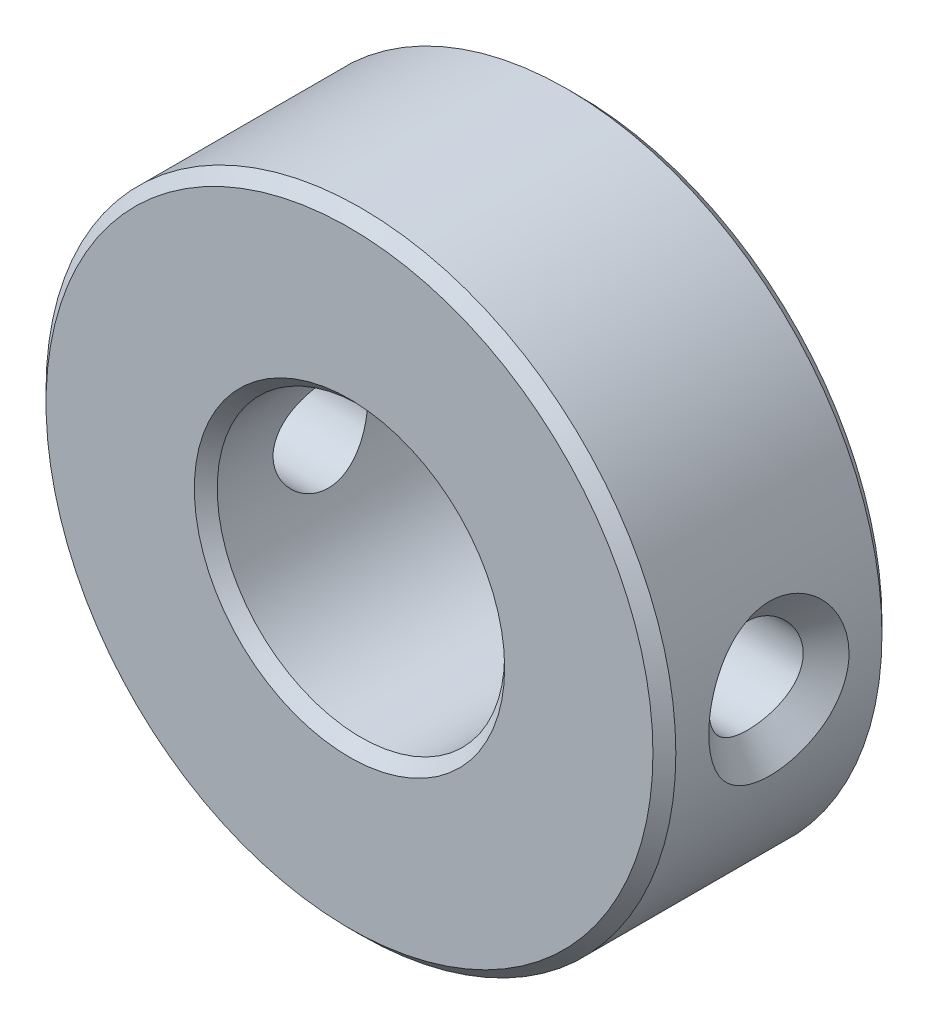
ISO-10303-21;
HEADER;
FILE_DESCRIPTION(('STEP AP214'),'2;1');
FILE_NAME('part.step','',(''),(''),'','','');
FILE_SCHEMA(('AUTOMOTIVE_DESIGN { 1 0 10303 214 1 1 1 1 }'));
ENDSEC;
DATA;
#1=APPLICATION_CONTEXT('core data for automotive mechanical design processes');
#2=APPLICATION_PROTOCOL_DEFINITION('international standard','automotive_design',2000,#1);
#3=PRODUCT_CONTEXT('',#1,'mechanical');
#4=PRODUCT('Part','Part','',(#3));
#5=PRODUCT_RELATED_PRODUCT_CATEGORY('part','',(#4));
#6=PRODUCT_DEFINITION_FORMATION('','',#4);
#7=PRODUCT_DEFINITION_CONTEXT('part definition',#1,'design');
#8=PRODUCT_DEFINITION('design','',#6,#7);
#9=PRODUCT_DEFINITION_SHAPE('','',#8);
#10=(LENGTH_UNIT() NAMED_UNIT(*) SI_UNIT(.MILLI.,.METRE.));
#11=(NAMED_UNIT(*) PLANE_ANGLE_UNIT() SI_UNIT($,.RADIAN.));
#12=(NAMED_UNIT(*) SI_UNIT($,.STERADIAN.) SOLID_ANGLE_UNIT());
#13=UNCERTAINTY_MEASURE_WITH_UNIT(LENGTH_MEASURE(1.E-05),#10,'distance_accuracy_value','');
#14=(GEOMETRIC_REPRESENTATION_CONTEXT(3) GLOBAL_UNCERTAINTY_ASSIGNED_CONTEXT((#13)) GLOBAL_UNIT_ASSIGNED_CONTEXT((#10,
#11,#12)) REPRESENTATION_CONTEXT('',''));
#15=CARTESIAN_POINT('',(0.,0.,0.));
#16=DIRECTION('',(0.,0.,1.));
#17=DIRECTION('',(1.,0.,0.));
#18=AXIS2_PLACEMENT_3D('',#15,#16,#17);
#19=CARTESIAN_POINT('',(0.,0.,10.));
#20=DIRECTION('',(0.,0.,1.));
#21=DIRECTION('',(1.,0.,0.));
#22=AXIS2_PLACEMENT_3D('',#19,#20,#21);
#23=PLANE('',#22);
#24=CARTESIAN_POINT('',(0.,0.,10.));
#25=DIRECTION('',(0.,0.,1.));
#26=DIRECTION('',(1.,0.,0.));
#27=AXIS2_PLACEMENT_3D('',#24,#25,#26);
#28=CIRCLE('',#27,13.55);
#29=CARTESIAN_POINT('',(13.55,0.,10.));
#30=VERTEX_POINT('',#29);
#31=EDGE_CURVE('E94',#30,#30,#28,.F.);
#32=ORIENTED_EDGE('',*,*,#31,.T.);
#33=EDGE_LOOP('',(#32));
#34=FACE_BOUND('',#33,.T.);
#35=CARTESIAN_POINT('',(0.,0.,10.));
#36=DIRECTION('',(0.,0.,1.));
#37=DIRECTION('',(1.,0.,0.));
#38=AXIS2_PLACEMENT_3D('',#35,#36,#37);
#39=CIRCLE('',#38,26.5);
#40=CARTESIAN_POINT('',(26.5,0.,10.));
#41=VERTEX_POINT('',#40);
#42=EDGE_CURVE('E91',#41,#41,#39,.T.);
#43=ORIENTED_EDGE('',*,*,#42,.T.);
#44=EDGE_LOOP('',(#43));
#45=FACE_BOUND('',#44,.T.);
#46=ADVANCED_FACE('F28',(#34,#45),#23,.T.);
#47=CARTESIAN_POINT('',(0.,0.,-10.));
#48=DIRECTION('',(0.,0.,1.));
#49=DIRECTION('',(1.,0.,0.));
#50=AXIS2_PLACEMENT_3D('',#47,#48,#49);
#51=PLANE('',#50);
#52=CARTESIAN_POINT('',(18.1865334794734,-10.4999999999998,-9.99999999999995));
#53=DIRECTION('',(0.,0.,-1.));
#54=DIRECTION('',(-1.,0.,0.));
#55=AXIS2_PLACEMENT_3D('',#52,#53,#54);
#56=CIRCLE('',#55,3.6);
#57=CARTESIAN_POINT('',(14.5865334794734,-10.4999999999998,-9.99999999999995));
#58=VERTEX_POINT('',#57);
#59=EDGE_CURVE('E67',#58,#58,#56,.T.);
#60=ORIENTED_EDGE('',*,*,#59,.F.);
#61=EDGE_LOOP('',(#60));
#62=FACE_BOUND('',#61,.T.);
#63=CARTESIAN_POINT('',(-18.1865334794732,-10.5000000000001,-9.99999999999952));
#64=DIRECTION('',(0.,0.,-1.));
#65=DIRECTION('',(-1.,0.,0.));
#66=AXIS2_PLACEMENT_3D('',#63,#64,#65);
#67=CIRCLE('',#66,3.6);
#68=CARTESIAN_POINT('',(-21.7865334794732,-10.5000000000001,-9.99999999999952));
#69=VERTEX_POINT('',#68);
#70=EDGE_CURVE('E60',#69,#69,#67,.T.);
#71=ORIENTED_EDGE('',*,*,#70,.F.);
#72=EDGE_LOOP('',(#71));
#73=FACE_BOUND('',#72,.T.);
#74=CARTESIAN_POINT('',(0.,21.,-10.));
#75=DIRECTION('',(0.,0.,-1.));
#76=DIRECTION('',(-1.,0.,0.));
#77=AXIS2_PLACEMENT_3D('',#74,#75,#76);
#78=CIRCLE('',#77,3.6);
#79=CARTESIAN_POINT('',(-3.6,21.,-10.));
#80=VERTEX_POINT('',#79);
#81=EDGE_CURVE('E76',#80,#80,#78,.T.);
#82=ORIENTED_EDGE('',*,*,#81,.F.);
#83=EDGE_LOOP('',(#82));
#84=FACE_BOUND('',#83,.T.);
#85=CARTESIAN_POINT('',(0.,0.,-10.));
#86=DIRECTION('',(0.,0.,1.));
#87=DIRECTION('',(1.,0.,0.));
#88=AXIS2_PLACEMENT_3D('',#85,#86,#87);
#89=CIRCLE('',#88,13.55);
#90=CARTESIAN_POINT('',(13.55,0.,-10.));
#91=VERTEX_POINT('',#90);
#92=EDGE_CURVE('E106',#91,#91,#89,.T.);
#93=ORIENTED_EDGE('',*,*,#92,.T.);
#94=EDGE_LOOP('',(#93));
#95=FACE_BOUND('',#94,.T.);
#96=CARTESIAN_POINT('',(0.,0.,-10.));
#97=DIRECTION('',(0.,0.,1.));
#98=DIRECTION('',(1.,0.,0.));
#99=AXIS2_PLACEMENT_3D('',#96,#97,#98);
#100=CIRCLE('',#99,26.5);
#101=CARTESIAN_POINT('',(26.5,0.,-10.));
#102=VERTEX_POINT('',#101);
#103=EDGE_CURVE('E103',#102,#102,#100,.F.);
#104=ORIENTED_EDGE('',*,*,#103,.T.);
#105=EDGE_LOOP('',(#104));
#106=FACE_BOUND('',#105,.T.);
#107=ADVANCED_FACE('F188',(#62,#73,#84,#95,#106),#51,.F.);
#108=CARTESIAN_POINT('',(0.,0.,10.));
#109=DIRECTION('',(0.,0.,-1.));
#110=DIRECTION('',(-1.,0.,0.));
#111=AXIS2_PLACEMENT_3D('',#108,#109,#110);
#112=CYLINDRICAL_SURFACE('',#111,27.5);
#113=CARTESIAN_POINT('',(27.5,0.,-6.12499991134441));
#114=CARTESIAN_POINT('',(27.5000168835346,0.108624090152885,-6.12507872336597));
#115=CARTESIAN_POINT('',(27.4993093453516,0.217246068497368,-6.12256523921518));
#116=CARTESIAN_POINT('',(27.4965180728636,0.434027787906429,-6.11243420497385));
#117=CARTESIAN_POINT('',(27.4944369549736,0.542188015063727,-6.10482635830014));
#118=CARTESIAN_POINT('',(27.4889753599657,0.757818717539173,-6.08460412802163));
#119=CARTESIAN_POINT('',(27.4855971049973,0.865290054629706,-6.07199830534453));
#120=CARTESIAN_POINT('',(27.4776184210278,1.079318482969,-6.04187844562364));
#121=CARTESIAN_POINT('',(27.4730199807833,1.18587677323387,-6.02437239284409));
#122=CARTESIAN_POINT('',(27.4626778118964,1.39785383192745,-5.98454944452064));
#123=CARTESIAN_POINT('',(27.4569359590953,1.50327417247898,-5.96224042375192));
#124=CARTESIAN_POINT('',(27.4443837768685,1.71275020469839,-5.91290855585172));
#125=CARTESIAN_POINT('',(27.437575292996,1.81680792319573,-5.88589384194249));
#126=CARTESIAN_POINT('',(27.4229665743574,2.02333342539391,-5.82724721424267));
#127=CARTESIAN_POINT('',(27.4151682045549,2.12580380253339,-5.79562396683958));
#128=CARTESIAN_POINT('',(27.3986563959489,2.32892922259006,-5.72785663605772));
#129=CARTESIAN_POINT('',(27.3899448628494,2.4295875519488,-5.69172193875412));
#130=CARTESIAN_POINT('',(27.371683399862,2.62886333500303,-5.61502788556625));
#131=CARTESIAN_POINT('',(27.3621354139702,2.72748489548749,-5.57447873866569));
#132=CARTESIAN_POINT('',(27.3422776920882,2.92246146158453,-5.48905186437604));
#133=CARTESIAN_POINT('',(27.3319699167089,3.01882150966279,-5.44418519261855));
#134=CARTESIAN_POINT('',(27.310669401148,3.20904926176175,-5.35021931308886));
#135=CARTESIAN_POINT('',(27.2996786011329,3.30292303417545,-5.30113195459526));
#136=CARTESIAN_POINT('',(27.2770884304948,3.48795231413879,-5.198820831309));
#137=CARTESIAN_POINT('',(27.2654909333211,3.57911496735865,-5.14560958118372));
#138=CARTESIAN_POINT('',(27.2417654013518,3.75849618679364,-5.03514680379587));
#139=CARTESIAN_POINT('',(27.2296391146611,3.84672297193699,-4.97790825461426));
#140=CARTESIAN_POINT('',(27.2049281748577,4.02000609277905,-4.85948767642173));
#141=CARTESIAN_POINT('',(27.1923451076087,4.10507164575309,-4.79831881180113));
#142=CARTESIAN_POINT('',(27.1668147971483,4.27180806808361,-4.67213293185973));
#143=CARTESIAN_POINT('',(27.1538688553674,4.35348897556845,-4.60712892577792));
#144=CARTESIAN_POINT('',(27.127625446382,4.51322447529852,-4.47337490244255));
#145=CARTESIAN_POINT('',(27.1143292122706,4.59128966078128,-4.40463730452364));
#146=CARTESIAN_POINT('',(27.0877094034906,4.74354228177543,-4.26353937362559));
#147=CARTESIAN_POINT('',(27.0743860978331,4.81774261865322,-4.19119291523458));
#148=CARTESIAN_POINT('',(27.0480441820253,4.96212636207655,-4.04311214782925));
#149=CARTESIAN_POINT('',(27.0350245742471,5.03232451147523,-3.96739238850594));
#150=CARTESIAN_POINT('',(27.0093095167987,5.16859110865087,-3.81278247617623));
#151=CARTESIAN_POINT('',(26.9966130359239,5.23467403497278,-3.73390525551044));
#152=CARTESIAN_POINT('',(26.9716445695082,5.36260477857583,-3.57319104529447));
#153=CARTESIAN_POINT('',(26.9593712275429,5.42446690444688,-3.4913656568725));
#154=CARTESIAN_POINT('',(26.9353278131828,5.54384850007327,-3.32496721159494));
#155=CARTESIAN_POINT('',(26.9235561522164,5.60138220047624,-3.24040459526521));
#156=CARTESIAN_POINT('',(26.9006006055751,5.71199983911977,-3.06874316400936));
#157=CARTESIAN_POINT('',(26.8894148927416,5.76509796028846,-2.9816537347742));
#158=CARTESIAN_POINT('',(26.8677142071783,5.86673715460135,-2.80515017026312));
#159=CARTESIAN_POINT('',(26.8571971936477,5.91529232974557,-2.71574440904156));
#160=CARTESIAN_POINT('',(26.8369172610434,6.00773841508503,-2.534819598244));
#161=CARTESIAN_POINT('',(26.8271521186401,6.05164323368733,-2.44330790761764));
#162=CARTESIAN_POINT('',(26.8084591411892,6.13468149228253,-2.25838266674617));
#163=CARTESIAN_POINT('',(26.7995289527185,6.1738284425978,-2.16497542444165));
#164=CARTESIAN_POINT('',(26.7825890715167,6.24724405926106,-1.97647053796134));
#165=CARTESIAN_POINT('',(26.774576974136,6.28152552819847,-1.88137809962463));
#166=CARTESIAN_POINT('',(26.7595563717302,6.34510359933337,-1.68971432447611));
#167=CARTESIAN_POINT('',(26.7525455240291,6.37441186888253,-1.59314704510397));
#168=CARTESIAN_POINT('',(26.7396104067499,6.42793736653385,-1.39874512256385));
#169=CARTESIAN_POINT('',(26.733684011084,6.45216457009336,-1.30091337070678));
#170=CARTESIAN_POINT('',(26.7230006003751,6.49542243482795,-1.10419405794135));
#171=CARTESIAN_POINT('',(26.7182418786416,6.51446068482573,-1.00530826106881));
#172=CARTESIAN_POINT('',(26.709976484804,6.54723545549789,-0.806692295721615));
#173=CARTESIAN_POINT('',(26.7064687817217,6.56097634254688,-0.706962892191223));
#174=CARTESIAN_POINT('',(26.7007875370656,6.58305351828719,-0.506871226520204));
#175=CARTESIAN_POINT('',(26.6986139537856,6.59138997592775,-0.406508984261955));
#176=CARTESIAN_POINT('',(26.6956838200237,6.60255093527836,-0.205362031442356));
#177=CARTESIAN_POINT('',(26.6949285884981,6.60537030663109,-0.104577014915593));
#178=CARTESIAN_POINT('',(26.6949136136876,6.60541126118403,0.0969912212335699));
#179=CARTESIAN_POINT('',(26.6956538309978,6.60263299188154,0.197774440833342));
#180=CARTESIAN_POINT('',(26.6985485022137,6.59158328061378,0.398916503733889));
#181=CARTESIAN_POINT('',(26.7007015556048,6.58331727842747,0.499275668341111));
#182=CARTESIAN_POINT('',(26.7063387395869,6.56139882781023,0.699361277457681));
#183=CARTESIAN_POINT('',(26.7098228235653,6.54774656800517,0.799087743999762));
#184=CARTESIAN_POINT('',(26.7180382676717,6.51516654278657,0.997699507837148));
#185=CARTESIAN_POINT('',(26.7227705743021,6.49623477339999,1.09658410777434));
#186=CARTESIAN_POINT('',(26.7333992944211,6.45320416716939,1.29330422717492));
#187=CARTESIAN_POINT('',(26.7392973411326,6.42909807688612,1.39113806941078));
#188=CARTESIAN_POINT('',(26.7521745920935,6.37582671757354,1.58554892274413));
#189=CARTESIAN_POINT('',(26.759155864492,6.34665175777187,1.68212313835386));
#190=CARTESIAN_POINT('',(26.7741168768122,6.28334964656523,1.87380709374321));
#191=CARTESIAN_POINT('',(26.7820989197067,6.24921104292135,1.9689128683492));
#192=CARTESIAN_POINT('',(26.7989789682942,6.17608799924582,2.15745230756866));
#193=CARTESIAN_POINT('',(26.8078793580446,6.1370908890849,2.25088084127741));
#194=CARTESIAN_POINT('',(26.8265137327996,6.05435665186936,2.43585813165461));
#195=CARTESIAN_POINT('',(26.8362500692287,6.01060605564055,2.52740062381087));
#196=CARTESIAN_POINT('',(26.8564741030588,5.91847026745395,2.70839810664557));
#197=CARTESIAN_POINT('',(26.8669640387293,5.87007111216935,2.79784573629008));
#198=CARTESIAN_POINT('',(26.8886130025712,5.76874332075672,2.97444571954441));
#199=CARTESIAN_POINT('',(26.8997741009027,5.71580043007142,3.06158963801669));
#200=CARTESIAN_POINT('',(26.9226835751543,5.60549014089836,3.23337437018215));
#201=CARTESIAN_POINT('',(26.934433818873,5.54810831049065,3.3180056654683));
#202=CARTESIAN_POINT('',(26.9584382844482,5.429024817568,3.4845573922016));
#203=CARTESIAN_POINT('',(26.9706941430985,5.36730858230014,3.56646716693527));
#204=CARTESIAN_POINT('',(26.995632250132,5.23966163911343,3.72736788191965));
#205=CARTESIAN_POINT('',(27.0083159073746,5.173716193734,3.80634691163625));
#206=CARTESIAN_POINT('',(27.0340106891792,5.03771353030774,3.96117925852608));
#207=CARTESIAN_POINT('',(27.047022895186,4.96764132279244,4.03701922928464));
#208=CARTESIAN_POINT('',(27.0733560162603,4.8234980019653,4.18536308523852));
#209=CARTESIAN_POINT('',(27.0866779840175,4.74941157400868,4.25785190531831));
#210=CARTESIAN_POINT('',(27.1133008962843,4.59737234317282,4.39924376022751));
#211=CARTESIAN_POINT('',(27.1266015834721,4.51940632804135,4.46813263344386));
#212=CARTESIAN_POINT('',(27.1528582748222,4.35985404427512,4.60218283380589));
#213=CARTESIAN_POINT('',(27.1658130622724,4.27825715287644,4.66733174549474));
#214=CARTESIAN_POINT('',(27.1913649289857,4.11167627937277,4.7938033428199));
#215=CARTESIAN_POINT('',(27.2039607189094,4.02668221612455,4.85511300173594));
#216=CARTESIAN_POINT('',(27.2287005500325,3.85352965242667,4.97381049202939));
#217=CARTESIAN_POINT('',(27.2408430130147,3.76536187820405,5.03118511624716));
#218=CARTESIAN_POINT('',(27.2646039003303,3.58608700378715,5.14191554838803));
#219=CARTESIAN_POINT('',(27.276220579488,3.49497162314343,5.19525831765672));
#220=CARTESIAN_POINT('',(27.2988516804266,3.31002576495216,5.29782795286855));
#221=CARTESIAN_POINT('',(27.3098642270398,3.2161880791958,5.34704222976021));
#222=CARTESIAN_POINT('',(27.3312103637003,3.02602197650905,5.44125743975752));
#223=CARTESIAN_POINT('',(27.3415420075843,2.92968743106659,5.48624643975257));
#224=CARTESIAN_POINT('',(27.3614491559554,2.73475192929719,5.5719134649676));
#225=CARTESIAN_POINT('',(27.3710226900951,2.63614587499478,5.61258034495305));
#226=CARTESIAN_POINT('',(27.3893364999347,2.43689174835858,5.68950535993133));
#227=CARTESIAN_POINT('',(27.398074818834,2.33623951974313,5.72575319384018));
#228=CARTESIAN_POINT('',(27.4146410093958,2.13311752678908,5.79374228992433));
#229=CARTESIAN_POINT('',(27.4224669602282,2.0306444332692,5.82547407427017));
#230=CARTESIAN_POINT('',(27.4371312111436,1.8241053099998,5.88433326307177));
#231=CARTESIAN_POINT('',(27.4439676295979,1.72003665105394,5.91145191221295));
#232=CARTESIAN_POINT('',(27.4565756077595,1.5105311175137,5.9609871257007));
#233=CARTESIAN_POINT('',(27.4623453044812,1.40509218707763,5.98339547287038));
#234=CARTESIAN_POINT('',(27.4727426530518,1.19307096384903,6.02341255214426));
#235=CARTESIAN_POINT('',(27.4773684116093,1.08648707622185,6.04101333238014));
#236=CARTESIAN_POINT('',(27.4854007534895,0.872400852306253,6.07131806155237));
#237=CARTESIAN_POINT('',(27.4888053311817,0.764897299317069,6.08401395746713));
#238=CARTESIAN_POINT('',(27.4943182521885,0.549196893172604,6.10441192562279));
#239=CARTESIAN_POINT('',(27.4964243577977,0.44099916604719,6.11210537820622));
#240=CARTESIAN_POINT('',(27.4992634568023,0.224134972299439,6.12240248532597));
#241=CARTESIAN_POINT('',(27.4999938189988,0.115468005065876,6.12499638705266));
#242=CARTESIAN_POINT('',(27.5000045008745,-0.101903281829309,6.12499694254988));
#243=CARTESIAN_POINT('',(27.4992843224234,-0.210607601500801,6.12240181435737));
#244=CARTESIAN_POINT('',(27.4964660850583,-0.427615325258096,6.11210366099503));
#245=CARTESIAN_POINT('',(27.4943697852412,-0.535919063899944,6.10440715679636));
#246=CARTESIAN_POINT('',(27.4888769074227,-0.751891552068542,6.084006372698));
#247=CARTESIAN_POINT('',(27.4854818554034,-0.85956089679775,6.07130796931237));
#248=CARTESIAN_POINT('',(27.4774688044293,-1.07402992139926,6.04100221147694));
#249=CARTESIAN_POINT('',(27.4728522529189,-1.18083047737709,6.02340066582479));
#250=CARTESIAN_POINT('',(27.4624734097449,-1.3933273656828,5.9833870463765));
#251=CARTESIAN_POINT('',(27.4567125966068,-1.4990249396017,5.96098117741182));
#252=CARTESIAN_POINT('',(27.4441223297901,-1.70908114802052,5.91145683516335));
#253=CARTESIAN_POINT('',(27.4372944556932,-1.81344151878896,5.88434532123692));
#254=CARTESIAN_POINT('',(27.4226471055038,-2.02058846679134,5.82550727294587));
#255=CARTESIAN_POINT('',(27.4148293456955,-2.12337743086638,5.79378871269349));
#256=CARTESIAN_POINT('',(27.3982792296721,-2.32714653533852,5.72583389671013));
#257=CARTESIAN_POINT('',(27.3895487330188,-2.42812988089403,5.68960679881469));
#258=CARTESIAN_POINT('',(27.3712501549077,-2.62805254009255,5.61273206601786));
#259=CARTESIAN_POINT('',(27.3616840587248,-2.72699604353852,5.57209485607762));
#260=CARTESIAN_POINT('',(27.3417912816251,-2.92260363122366,5.48649697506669));
#261=CARTESIAN_POINT('',(27.3314666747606,-3.01927304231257,5.44154799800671));
#262=CARTESIAN_POINT('',(27.3101340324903,-3.21009691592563,5.34742365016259));
#263=CARTESIAN_POINT('',(27.2991281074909,-3.30425796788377,5.29826116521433));
#264=CARTESIAN_POINT('',(27.2765095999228,-3.4898294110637,5.19580696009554));
#265=CARTESIAN_POINT('',(27.2648991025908,-3.58124773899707,5.14252916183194));
#266=CARTESIAN_POINT('',(27.2411499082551,-3.76109814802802,5.03194157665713));
#267=CARTESIAN_POINT('',(27.2290131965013,-3.84953953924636,4.97464651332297));
#268=CARTESIAN_POINT('',(27.2042840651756,-4.02319969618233,4.85612211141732));
#269=CARTESIAN_POINT('',(27.1916934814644,-4.108429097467,4.79490798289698));
#270=CARTESIAN_POINT('',(27.1661515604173,-4.2754318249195,4.66864259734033));
#271=CARTESIAN_POINT('',(27.153201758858,-4.3572169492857,4.60360664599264));
#272=CARTESIAN_POINT('',(27.1269533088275,-4.517087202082,4.46979840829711));
#273=CARTESIAN_POINT('',(27.1136561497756,-4.59518504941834,4.40104103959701));
#274=CARTESIAN_POINT('',(27.0870382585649,-4.74744871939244,4.259905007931));
#275=CARTESIAN_POINT('',(27.0737178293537,-4.82162891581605,4.18754179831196));
#276=CARTESIAN_POINT('',(27.0473859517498,-4.96595085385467,4.03942478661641));
#277=CARTESIAN_POINT('',(27.0343734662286,-5.03610780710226,3.96368598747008));
#278=CARTESIAN_POINT('',(27.0086754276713,-5.17227123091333,3.80903475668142));
#279=CARTESIAN_POINT('',(26.9959888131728,-5.2382925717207,3.7301355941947));
#280=CARTESIAN_POINT('',(26.971042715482,-5.36608321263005,3.56937683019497));
#281=CARTESIAN_POINT('',(26.9587818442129,-5.42786713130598,3.48752906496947));
#282=CARTESIAN_POINT('',(26.9347655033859,-5.54707839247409,3.32108691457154));
#283=CARTESIAN_POINT('',(26.9230084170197,-5.60452020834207,3.23650313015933));
#284=CARTESIAN_POINT('',(26.9000837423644,-5.71494337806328,3.06480232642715));
#285=CARTESIAN_POINT('',(26.8889143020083,-5.76793910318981,2.97769479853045));
#286=CARTESIAN_POINT('',(26.8672474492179,-5.8693659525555,2.8011598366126));
#287=CARTESIAN_POINT('',(26.8567479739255,-5.91781132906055,2.71174084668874));
#288=CARTESIAN_POINT('',(26.8365039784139,-6.01003341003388,2.53079621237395));
#289=CARTESIAN_POINT('',(26.826757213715,-6.05382415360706,2.43927797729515));
#290=CARTESIAN_POINT('',(26.8081014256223,-6.13663297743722,2.25434809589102));
#291=CARTESIAN_POINT('',(26.7991900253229,-6.17566470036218,2.16094280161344));
#292=CARTESIAN_POINT('',(26.7822877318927,-6.248851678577,1.97245206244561));
#293=CARTESIAN_POINT('',(26.7742944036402,-6.28301989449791,1.8773718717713));
#294=CARTESIAN_POINT('',(26.7593109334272,-6.34637635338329,1.68574463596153));
#295=CARTESIAN_POINT('',(26.7523184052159,-6.37557647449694,1.58920170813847));
#296=CARTESIAN_POINT('',(26.7394191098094,-6.42889361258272,1.39486231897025));
#297=CARTESIAN_POINT('',(26.7335101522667,-6.45302089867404,1.29706882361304));
#298=CARTESIAN_POINT('',(26.7228603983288,-6.49608990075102,1.10044163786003));
#299=CARTESIAN_POINT('',(26.7181178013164,-6.51503961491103,1.00160979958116));
#300=CARTESIAN_POINT('',(26.7098830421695,-6.5476512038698,0.803119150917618));
#301=CARTESIAN_POINT('',(26.706389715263,-6.56131800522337,0.703461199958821));
#302=CARTESIAN_POINT('',(26.7007352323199,-6.58326409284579,0.503531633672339));
#303=CARTESIAN_POINT('',(26.6985738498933,-6.59154429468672,0.403260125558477));
#304=CARTESIAN_POINT('',(26.6956657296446,-6.60261182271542,0.202315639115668));
#305=CARTESIAN_POINT('',(26.6949200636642,-6.60539498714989,0.101642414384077));
#306=CARTESIAN_POINT('',(26.6949215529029,-6.6053889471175,-0.0996961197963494));
#307=CARTESIAN_POINT('',(26.6956685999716,-6.60260014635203,-0.200361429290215));
#308=CARTESIAN_POINT('',(26.6985742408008,-6.59155514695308,-0.401277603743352));
#309=CARTESIAN_POINT('',(26.7007315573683,-6.58330389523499,-0.501528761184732));
#310=CARTESIAN_POINT('',(26.7063749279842,-6.56143482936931,-0.701407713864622));
#311=CARTESIAN_POINT('',(26.7098610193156,-6.54781686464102,-0.801035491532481));
#312=CARTESIAN_POINT('',(26.7180785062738,-6.51532064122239,-0.99945867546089));
#313=CARTESIAN_POINT('',(26.722810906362,-6.49643813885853,-1.09825334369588));
#314=CARTESIAN_POINT('',(26.733438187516,-6.45351634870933,-1.29480182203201));
#315=CARTESIAN_POINT('',(26.7393347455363,-6.42946961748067,-1.3925539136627));
#316=CARTESIAN_POINT('',(26.7522077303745,-6.37632246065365,-1.58680891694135));
#317=CARTESIAN_POINT('',(26.7591862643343,-6.34721216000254,-1.6833089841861));
#318=CARTESIAN_POINT('',(26.7741408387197,-6.28404007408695,-1.87485173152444));
#319=CARTESIAN_POINT('',(26.7821192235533,-6.24996661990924,-1.96989037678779));
#320=CARTESIAN_POINT('',(26.7989913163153,-6.17696984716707,-2.15830209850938));
#321=CARTESIAN_POINT('',(26.8078874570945,-6.13803357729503,-2.25166993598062));
#322=CARTESIAN_POINT('',(26.8265130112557,-6.05541228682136,-2.43653184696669));
#323=CARTESIAN_POINT('',(26.8362448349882,-6.01171342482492,-2.52801948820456));
#324=CARTESIAN_POINT('',(26.8564598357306,-5.9196676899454,-2.70891277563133));
#325=CARTESIAN_POINT('',(26.8669453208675,-5.87130636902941,-2.7983108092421));
#326=CARTESIAN_POINT('',(26.8885856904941,-5.77003617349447,-2.97481662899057));
#327=CARTESIAN_POINT('',(26.8997427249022,-5.71711243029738,-3.06191561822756));
#328=CARTESIAN_POINT('',(26.9226446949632,-5.60681770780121,-3.23361505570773));
#329=CARTESIAN_POINT('',(26.934391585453,-5.54943154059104,-3.31820548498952));
#330=CARTESIAN_POINT('',(26.9583902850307,-5.43031205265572,-3.48467966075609));
#331=CARTESIAN_POINT('',(26.9706438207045,-5.36856325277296,-3.56655208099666));
#332=CARTESIAN_POINT('',(26.9955785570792,-5.24081908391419,-3.72738171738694));
#333=CARTESIAN_POINT('',(27.0082612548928,-5.17480791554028,-3.8063261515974));
#334=CARTESIAN_POINT('',(27.033955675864,-5.03863765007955,-3.96109316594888));
#335=CARTESIAN_POINT('',(27.0469685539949,-4.96846234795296,-4.03690129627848));
#336=CARTESIAN_POINT('',(27.0733051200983,-4.82406995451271,-4.18518278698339));
#337=CARTESIAN_POINT('',(27.0866299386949,-4.74983617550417,-4.25763969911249));
#338=CARTESIAN_POINT('',(27.1132585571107,-4.59747158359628,-4.39896891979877));
#339=CARTESIAN_POINT('',(27.1265620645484,-4.51932649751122,-4.4678258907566));
#340=CARTESIAN_POINT('',(27.1528226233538,-4.35940354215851,-4.60181546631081));
#341=CARTESIAN_POINT('',(27.1657783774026,-4.27761447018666,-4.6669349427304));
#342=CARTESIAN_POINT('',(27.1913309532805,-4.11063856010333,-4.79334935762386));
#343=CARTESIAN_POINT('',(27.2039264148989,-4.02544117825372,-4.85463063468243));
#344=CARTESIAN_POINT('',(27.2286645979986,-3.8518757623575,-4.97327443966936));
#345=CARTESIAN_POINT('',(27.240805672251,-3.76349811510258,-5.03062323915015));
#346=CARTESIAN_POINT('',(27.2645631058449,-3.58380104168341,-5.14130568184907));
#347=CARTESIAN_POINT('',(27.2761776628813,-3.49247311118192,-5.19462589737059));
#348=CARTESIAN_POINT('',(27.2988041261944,-3.30710365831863,-5.29715485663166));
#349=CARTESIAN_POINT('',(27.3098141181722,-3.21305481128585,-5.34635077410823));
#350=CARTESIAN_POINT('',(27.3311550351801,-3.02247180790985,-5.4405343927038));
#351=CARTESIAN_POINT('',(27.3414840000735,-2.9259315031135,-5.48551009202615));
#352=CARTESIAN_POINT('',(27.3613859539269,-2.73059384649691,-5.57115633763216));
#353=CARTESIAN_POINT('',(27.37095699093,-2.63179146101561,-5.61181585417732));
#354=CARTESIAN_POINT('',(27.3892662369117,-2.4321579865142,-5.68873263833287));
#355=CARTESIAN_POINT('',(27.3980025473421,-2.33132287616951,-5.7249799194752));
#356=CARTESIAN_POINT('',(27.4145654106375,-2.12785240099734,-5.79297506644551));
#357=CARTESIAN_POINT('',(27.422390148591,-2.02521389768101,-5.82471398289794));
#358=CARTESIAN_POINT('',(27.4370529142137,-1.8183652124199,-5.88359523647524));
#359=CARTESIAN_POINT('',(27.443889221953,-1.71415263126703,-5.9107295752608));
#360=CARTESIAN_POINT('',(27.456498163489,-1.50438452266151,-5.96030460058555));
#361=CARTESIAN_POINT('',(27.4622691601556,-1.39882719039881,-5.98273807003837));
#362=CARTESIAN_POINT('',(27.4726705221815,-1.18659839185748,-6.02281443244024));
#363=CARTESIAN_POINT('',(27.4772992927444,-1.07992558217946,-6.04045063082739));
#364=CARTESIAN_POINT('',(27.4853393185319,-0.865694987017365,-6.0708358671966));
#365=CARTESIAN_POINT('',(27.4887489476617,-0.758136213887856,-6.08357837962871));
#366=CARTESIAN_POINT('',(27.4942737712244,-0.542362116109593,-6.10407971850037));
#367=CARTESIAN_POINT('',(27.4963871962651,-0.43414609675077,-6.11183173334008));
#368=CARTESIAN_POINT('',(27.4992432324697,-0.217289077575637,-6.12225712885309));
#369=CARTESIAN_POINT('',(27.4999837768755,-0.108647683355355,-6.12492285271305));
#370=CARTESIAN_POINT('',(27.5,0.,-6.12499991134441));
#371=B_SPLINE_CURVE_WITH_KNOTS('',3,(#113,#114,#115,#116,#117,#118,#119,#120,#121,#122,#123,
#124,#125,#126,#127,#128,#129,#130,#131,#132,#133,#134,#135,#136,#137,#138,#139,#140,#141,#142,
#143,#144,#145,#146,#147,#148,#149,#150,#151,#152,#153,#154,#155,#156,#157,#158,#159,#160,#161,
#162,#163,#164,#165,#166,#167,#168,#169,#170,#171,#172,#173,#174,#175,#176,#177,#178,#179,#180,
#181,#182,#183,#184,#185,#186,#187,#188,#189,#190,#191,#192,#193,#194,#195,#196,#197,#198,#199,
#200,#201,#202,#203,#204,#205,#206,#207,#208,#209,#210,#211,#212,#213,#214,#215,#216,#217,#218,
#219,#220,#221,#222,#223,#224,#225,#226,#227,#228,#229,#230,#231,#232,#233,#234,#235,#236,#237,
#238,#239,#240,#241,#242,#243,#244,#245,#246,#247,#248,#249,#250,#251,#252,#253,#254,#255,#256,
#257,#258,#259,#260,#261,#262,#263,#264,#265,#266,#267,#268,#269,#270,#271,#272,#273,#274,#275,
#276,#277,#278,#279,#280,#281,#282,#283,#284,#285,#286,#287,#288,#289,#290,#291,#292,#293,#294,
#295,#296,#297,#298,#299,#300,#301,#302,#303,#304,#305,#306,#307,#308,#309,#310,#311,#312,#313,
#314,#315,#316,#317,#318,#319,#320,#321,#322,#323,#324,#325,#326,#327,#328,#329,#330,#331,#332,
#333,#334,#335,#336,#337,#338,#339,#340,#341,#342,#343,#344,#345,#346,#347,#348,#349,#350,#351,
#352,#353,#354,#355,#356,#357,#358,#359,#360,#361,#362,#363,#364,#365,#366,#367,#368,#369,#370),
.UNSPECIFIED.,.F.,.F.,(4,2,2,2,2,2,2,2,2,2,2,2,2,2,2,2,2,2,2,2,2,2,2,2,2,2,2,2,2,2,2,2,2,2,2,2,
2,2,2,2,2,2,2,2,2,2,2,2,2,2,2,2,2,2,2,2,2,2,2,2,2,2,2,2,2,2,2,2,2,2,2,2,2,2,2,2,2,2,2,2,2,2,2,2,
2,2,2,2,2,2,2,2,2,2,2,2,2,2,2,2,2,2,2,2,2,2,2,2,2,2,2,2,2,2,2,2,2,2,2,2,2,2,2,2,2,2,2,2,4),(0.,
0.325833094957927,0.651047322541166,0.975706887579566,1.299840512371,1.62344669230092,
1.94649900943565,2.26895148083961,2.5907439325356,2.91180740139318,3.23206957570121,
3.55146029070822,3.86991709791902,4.18739092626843,4.50385184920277,4.81929496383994,
5.13374637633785,5.44707020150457,5.75915332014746,6.07006791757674,6.37986994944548,
6.68860436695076,6.99631045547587,7.30302727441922,7.60879918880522,7.9136814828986,
8.21774604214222,8.52108708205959,8.82382689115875,9.12612153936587,9.42816648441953,
9.73020198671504,10.0325182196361,10.3348264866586,10.6368355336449,10.9388340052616,
11.2410621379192,11.5437167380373,11.8469564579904,12.1509072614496,12.4556679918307,
12.7613159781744,13.0679126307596,13.3755089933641,13.6841512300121,13.9938860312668,
14.3047659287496,14.6168545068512,14.9302314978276,15.2447605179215,15.5602795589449,
15.8768168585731,16.1943692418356,16.5129081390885,16.8323854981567,17.1527395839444,
17.4739006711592,17.7957966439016,18.1183585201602,18.4415259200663,18.7652524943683,
19.0895113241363,19.4143002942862,19.7396474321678,20.0656161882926,20.3916969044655,
20.7173616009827,21.0426448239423,21.3675443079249,21.6920266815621,22.0160331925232,
22.3394854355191,22.6622910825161,22.9843496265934,23.3055581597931,23.6258172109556,
23.945036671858,24.2631418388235,24.5800795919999,24.8958247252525,25.2103864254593,
25.523699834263,25.8357377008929,26.1465802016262,26.4562899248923,26.7649170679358,
27.0725047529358,27.3790944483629,27.6847314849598,27.9894706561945,28.2933818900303,
28.5965559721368,28.8991102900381,29.2011945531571,29.5029964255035,29.8047469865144,
30.1067259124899,30.4086829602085,30.7103669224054,31.0120593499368,31.3139956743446,
31.616370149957,31.9193410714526,32.2230361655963,32.5275580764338,32.8329898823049,
33.1394005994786,33.4468506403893,33.7553972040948,34.0650995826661,34.3760243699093,
34.6882505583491,35.0018745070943,35.3167408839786,35.6326529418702,35.9496320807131,
36.2676667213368,36.5867184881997,36.9067282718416,37.227622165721,37.5493172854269,
37.8717274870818,38.194769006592,38.5183660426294,38.8424563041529,39.166996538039,
39.4919680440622,39.8173821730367,40.1432857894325),.UNSPECIFIED.);
#372=CARTESIAN_POINT('',(27.5,0.,-6.12499991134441));
#373=VERTEX_POINT('',#372);
#374=EDGE_CURVE('E267',#373,#373,#371,.F.);
#375=ORIENTED_EDGE('',*,*,#374,.T.);
#376=EDGE_LOOP('',(#375));
#377=FACE_BOUND('',#376,.T.);
#378=CARTESIAN_POINT('',(-27.5,0.,6.12499991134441));
#379=CARTESIAN_POINT('',(-27.5000168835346,0.108624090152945,6.12507872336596));
#380=CARTESIAN_POINT('',(-27.4993093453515,0.217246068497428,6.12256523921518));
#381=CARTESIAN_POINT('',(-27.4965180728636,0.43402778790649,6.11243420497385));
#382=CARTESIAN_POINT('',(-27.4944369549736,0.542188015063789,6.10482635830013));
#383=CARTESIAN_POINT('',(-27.4889753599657,0.757818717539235,6.08460412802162));
#384=CARTESIAN_POINT('',(-27.4855971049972,0.865290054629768,6.07199830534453));
#385=CARTESIAN_POINT('',(-27.4776184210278,1.07931848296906,6.04187844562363));
#386=CARTESIAN_POINT('',(-27.4730199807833,1.18587677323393,6.02437239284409));
#387=CARTESIAN_POINT('',(-27.4626778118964,1.39785383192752,5.98454944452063));
#388=CARTESIAN_POINT('',(-27.4569359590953,1.50327417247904,5.96224042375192));
#389=CARTESIAN_POINT('',(-27.4443837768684,1.71275020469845,5.91290855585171));
#390=CARTESIAN_POINT('',(-27.4375752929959,1.81680792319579,5.88589384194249));
#391=CARTESIAN_POINT('',(-27.4229665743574,2.02333342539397,5.82724721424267));
#392=CARTESIAN_POINT('',(-27.4151682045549,2.12580380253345,5.79562396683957));
#393=CARTESIAN_POINT('',(-27.3986563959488,2.32892922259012,5.72785663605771));
#394=CARTESIAN_POINT('',(-27.3899448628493,2.42958755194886,5.69172193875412));
#395=CARTESIAN_POINT('',(-27.3716833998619,2.62886333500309,5.61502788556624));
#396=CARTESIAN_POINT('',(-27.3621354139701,2.72748489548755,5.57447873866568));
#397=CARTESIAN_POINT('',(-27.3422776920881,2.92246146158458,5.48905186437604));
#398=CARTESIAN_POINT('',(-27.3319699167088,3.01882150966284,5.44418519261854));
#399=CARTESIAN_POINT('',(-27.3106694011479,3.2090492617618,5.35021931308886));
#400=CARTESIAN_POINT('',(-27.2996786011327,3.3029230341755,5.30113195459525));
#401=CARTESIAN_POINT('',(-27.2770884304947,3.48795231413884,5.19882083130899));
#402=CARTESIAN_POINT('',(-27.2654909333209,3.57911496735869,5.14560958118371));
#403=CARTESIAN_POINT('',(-27.2417654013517,3.75849618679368,5.03514680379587));
#404=CARTESIAN_POINT('',(-27.229639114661,3.84672297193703,4.97790825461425));
#405=CARTESIAN_POINT('',(-27.2049281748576,4.02000609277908,4.85948767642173));
#406=CARTESIAN_POINT('',(-27.1923451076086,4.10507164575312,4.79831881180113));
#407=CARTESIAN_POINT('',(-27.1668147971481,4.27180806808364,4.67213293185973));
#408=CARTESIAN_POINT('',(-27.1538688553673,4.35348897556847,4.60712892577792));
#409=CARTESIAN_POINT('',(-27.1276254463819,4.51322447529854,4.47337490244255));
#410=CARTESIAN_POINT('',(-27.1143292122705,4.59128966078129,4.40463730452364));
#411=CARTESIAN_POINT('',(-27.0877094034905,4.74354228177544,4.26353937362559));
#412=CARTESIAN_POINT('',(-27.074386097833,4.81774261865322,4.19119291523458));
#413=CARTESIAN_POINT('',(-27.0480441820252,4.96212636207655,4.04311214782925));
#414=CARTESIAN_POINT('',(-27.035024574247,5.03232451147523,3.96739238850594));
#415=CARTESIAN_POINT('',(-27.0093095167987,5.16859110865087,3.81278247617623));
#416=CARTESIAN_POINT('',(-26.9966130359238,5.23467403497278,3.73390525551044));
#417=CARTESIAN_POINT('',(-26.9716445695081,5.36260477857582,3.57319104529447));
#418=CARTESIAN_POINT('',(-26.9593712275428,5.42446690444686,3.4913656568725));
#419=CARTESIAN_POINT('',(-26.9353278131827,5.54384850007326,3.32496721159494));
#420=CARTESIAN_POINT('',(-26.9235561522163,5.60138220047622,3.24040459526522));
#421=CARTESIAN_POINT('',(-26.900600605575,5.71199983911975,3.06874316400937));
#422=CARTESIAN_POINT('',(-26.8894148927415,5.76509796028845,2.98165373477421));
#423=CARTESIAN_POINT('',(-26.8677142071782,5.86673715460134,2.80515017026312));
#424=CARTESIAN_POINT('',(-26.8571971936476,5.91529232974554,2.71574440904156));
#425=CARTESIAN_POINT('',(-26.8369172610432,6.00773841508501,2.53481959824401));
#426=CARTESIAN_POINT('',(-26.82715211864,6.05164323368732,2.44330790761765));
#427=CARTESIAN_POINT('',(-26.808459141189,6.13468149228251,2.25838266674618));
#428=CARTESIAN_POINT('',(-26.7995289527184,6.17382844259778,2.16497542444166));
#429=CARTESIAN_POINT('',(-26.7825890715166,6.24724405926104,1.97647053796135));
#430=CARTESIAN_POINT('',(-26.7745769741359,6.28152552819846,1.88137809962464));
#431=CARTESIAN_POINT('',(-26.7595563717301,6.34510359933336,1.68971432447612));
#432=CARTESIAN_POINT('',(-26.752545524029,6.37441186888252,1.59314704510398));
#433=CARTESIAN_POINT('',(-26.7396104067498,6.42793736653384,1.39874512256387));
#434=CARTESIAN_POINT('',(-26.7336840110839,6.45216457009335,1.30091337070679));
#435=CARTESIAN_POINT('',(-26.723000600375,6.49542243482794,1.10419405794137));
#436=CARTESIAN_POINT('',(-26.7182418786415,6.51446068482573,1.00530826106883));
#437=CARTESIAN_POINT('',(-26.7099764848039,6.54723545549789,0.806692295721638));
#438=CARTESIAN_POINT('',(-26.7064687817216,6.56097634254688,0.706962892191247));
#439=CARTESIAN_POINT('',(-26.7007875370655,6.5830535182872,0.506871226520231));
#440=CARTESIAN_POINT('',(-26.6986139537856,6.59138997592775,0.406508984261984));
#441=CARTESIAN_POINT('',(-26.6956838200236,6.60255093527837,0.205362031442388));
#442=CARTESIAN_POINT('',(-26.6949285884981,6.6053703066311,0.104577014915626));
#443=CARTESIAN_POINT('',(-26.6949136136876,6.60541126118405,-0.0969912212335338));
#444=CARTESIAN_POINT('',(-26.6956538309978,6.60263299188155,-0.197774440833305));
#445=CARTESIAN_POINT('',(-26.6985485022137,6.5915832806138,-0.398916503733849));
#446=CARTESIAN_POINT('',(-26.7007015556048,6.58331727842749,-0.49927566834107));
#447=CARTESIAN_POINT('',(-26.7063387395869,6.56139882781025,-0.699361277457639));
#448=CARTESIAN_POINT('',(-26.7098228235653,6.54774656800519,-0.79908774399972));
#449=CARTESIAN_POINT('',(-26.7180382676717,6.51516654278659,-0.997699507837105));
#450=CARTESIAN_POINT('',(-26.7227705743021,6.49623477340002,-1.09658410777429));
#451=CARTESIAN_POINT('',(-26.7333992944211,6.45320416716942,-1.29330422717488));
#452=CARTESIAN_POINT('',(-26.7392973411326,6.42909807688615,-1.39113806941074));
#453=CARTESIAN_POINT('',(-26.7521745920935,6.37582671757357,-1.58554892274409));
#454=CARTESIAN_POINT('',(-26.7591558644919,6.3466517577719,-1.68212313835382));
#455=CARTESIAN_POINT('',(-26.7741168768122,6.28334964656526,-1.87380709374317));
#456=CARTESIAN_POINT('',(-26.7820989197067,6.24921104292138,-1.96891286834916));
#457=CARTESIAN_POINT('',(-26.7989789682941,6.17608799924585,-2.15745230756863));
#458=CARTESIAN_POINT('',(-26.8078793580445,6.13709088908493,-2.25088084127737));
#459=CARTESIAN_POINT('',(-26.8265137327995,6.05435665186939,-2.43585813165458));
#460=CARTESIAN_POINT('',(-26.8362500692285,6.01060605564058,-2.52740062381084));
#461=CARTESIAN_POINT('',(-26.8564741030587,5.91847026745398,-2.70839810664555));
#462=CARTESIAN_POINT('',(-26.8669640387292,5.87007111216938,-2.79784573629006));
#463=CARTESIAN_POINT('',(-26.888613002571,5.76874332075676,-2.97444571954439));
#464=CARTESIAN_POINT('',(-26.8997741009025,5.71580043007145,-3.06158963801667));
#465=CARTESIAN_POINT('',(-26.9226835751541,5.60549014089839,-3.23337437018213));
#466=CARTESIAN_POINT('',(-26.9344338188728,5.54810831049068,-3.31800566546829));
#467=CARTESIAN_POINT('',(-26.958438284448,5.42902481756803,-3.48455739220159));
#468=CARTESIAN_POINT('',(-26.9706941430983,5.36730858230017,-3.56646716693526));
#469=CARTESIAN_POINT('',(-26.9956322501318,5.23966163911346,-3.72736788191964));
#470=CARTESIAN_POINT('',(-27.0083159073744,5.17371619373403,-3.80634691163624));
#471=CARTESIAN_POINT('',(-27.034010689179,5.03771353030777,-3.96117925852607));
#472=CARTESIAN_POINT('',(-27.0470228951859,4.96764132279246,-4.03701922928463));
#473=CARTESIAN_POINT('',(-27.0733560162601,4.82349800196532,-4.18536308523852));
#474=CARTESIAN_POINT('',(-27.0866779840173,4.74941157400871,-4.25785190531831));
#475=CARTESIAN_POINT('',(-27.1133008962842,4.59737234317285,-4.39924376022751));
#476=CARTESIAN_POINT('',(-27.126601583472,4.51940632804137,-4.46813263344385));
#477=CARTESIAN_POINT('',(-27.1528582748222,4.35985404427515,-4.60218283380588));
#478=CARTESIAN_POINT('',(-27.1658130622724,4.27825715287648,-4.66733174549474));
#479=CARTESIAN_POINT('',(-27.1913649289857,4.1116762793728,-4.7938033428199));
#480=CARTESIAN_POINT('',(-27.2039607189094,4.02668221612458,-4.85511300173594));
#481=CARTESIAN_POINT('',(-27.2287005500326,3.8535296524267,-4.97381049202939));
#482=CARTESIAN_POINT('',(-27.2408430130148,3.76536187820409,-5.03118511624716));
#483=CARTESIAN_POINT('',(-27.2646039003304,3.58608700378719,-5.14191554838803));
#484=CARTESIAN_POINT('',(-27.2762205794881,3.49497162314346,-5.19525831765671));
#485=CARTESIAN_POINT('',(-27.2988516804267,3.3100257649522,-5.29782795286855));
#486=CARTESIAN_POINT('',(-27.30986422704,3.21618807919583,-5.34704222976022));
#487=CARTESIAN_POINT('',(-27.3312103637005,3.02602197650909,-5.44125743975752));
#488=CARTESIAN_POINT('',(-27.3415420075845,2.92968743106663,-5.48624643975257));
#489=CARTESIAN_POINT('',(-27.3614491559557,2.73475192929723,-5.5719134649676));
#490=CARTESIAN_POINT('',(-27.3710226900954,2.63614587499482,-5.61258034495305));
#491=CARTESIAN_POINT('',(-27.389336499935,2.43689174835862,-5.68950535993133));
#492=CARTESIAN_POINT('',(-27.3980748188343,2.33623951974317,-5.72575319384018));
#493=CARTESIAN_POINT('',(-27.4146410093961,2.13311752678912,-5.79374228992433));
#494=CARTESIAN_POINT('',(-27.4224669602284,2.03064443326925,-5.82547407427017));
#495=CARTESIAN_POINT('',(-27.4371312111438,1.82410530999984,-5.88433326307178));
#496=CARTESIAN_POINT('',(-27.4439676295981,1.72003665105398,-5.91145191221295));
#497=CARTESIAN_POINT('',(-27.4565756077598,1.51053111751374,-5.9609871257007));
#498=CARTESIAN_POINT('',(-27.4623453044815,1.40509218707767,-5.98339547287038));
#499=CARTESIAN_POINT('',(-27.4727426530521,1.19307096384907,-6.02341255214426));
#500=CARTESIAN_POINT('',(-27.4773684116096,1.08648707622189,-6.04101333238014));
#501=CARTESIAN_POINT('',(-27.4854007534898,0.872400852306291,-6.07131806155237));
#502=CARTESIAN_POINT('',(-27.488805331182,0.764897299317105,-6.08401395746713));
#503=CARTESIAN_POINT('',(-27.4943182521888,0.549196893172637,-6.10441192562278));
#504=CARTESIAN_POINT('',(-27.496424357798,0.440999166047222,-6.11210537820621));
#505=CARTESIAN_POINT('',(-27.4992634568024,0.224134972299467,-6.12240248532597));
#506=CARTESIAN_POINT('',(-27.499993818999,0.115468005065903,-6.12499638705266));
#507=CARTESIAN_POINT('',(-27.5000045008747,-0.101903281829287,-6.12499694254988));
#508=CARTESIAN_POINT('',(-27.4992843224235,-0.210607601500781,-6.12240181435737));
#509=CARTESIAN_POINT('',(-27.4964660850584,-0.427615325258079,-6.11210366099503));
#510=CARTESIAN_POINT('',(-27.4943697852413,-0.53591906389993,-6.10440715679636));
#511=CARTESIAN_POINT('',(-27.4888769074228,-0.751891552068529,-6.084006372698));
#512=CARTESIAN_POINT('',(-27.4854818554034,-0.859560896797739,-6.07130796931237));
#513=CARTESIAN_POINT('',(-27.4774688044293,-1.07402992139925,-6.04100221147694));
#514=CARTESIAN_POINT('',(-27.4728522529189,-1.18083047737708,-6.02340066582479));
#515=CARTESIAN_POINT('',(-27.4624734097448,-1.39332736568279,-5.9833870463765));
#516=CARTESIAN_POINT('',(-27.4567125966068,-1.49902493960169,-5.96098117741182));
#517=CARTESIAN_POINT('',(-27.44412232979,-1.70908114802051,-5.91145683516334));
#518=CARTESIAN_POINT('',(-27.4372944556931,-1.81344151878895,-5.88434532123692));
#519=CARTESIAN_POINT('',(-27.4226471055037,-2.02058846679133,-5.82550727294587));
#520=CARTESIAN_POINT('',(-27.4148293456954,-2.12337743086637,-5.79378871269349));
#521=CARTESIAN_POINT('',(-27.398279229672,-2.32714653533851,-5.72583389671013));
#522=CARTESIAN_POINT('',(-27.3895487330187,-2.42812988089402,-5.68960679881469));
#523=CARTESIAN_POINT('',(-27.3712501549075,-2.62805254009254,-5.61273206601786));
#524=CARTESIAN_POINT('',(-27.3616840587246,-2.72699604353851,-5.57209485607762));
#525=CARTESIAN_POINT('',(-27.3417912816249,-2.92260363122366,-5.48649697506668));
#526=CARTESIAN_POINT('',(-27.3314666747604,-3.01927304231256,-5.4415479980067));
#527=CARTESIAN_POINT('',(-27.3101340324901,-3.21009691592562,-5.34742365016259));
#528=CARTESIAN_POINT('',(-27.2991281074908,-3.30425796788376,-5.29826116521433));
#529=CARTESIAN_POINT('',(-27.2765095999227,-3.48982941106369,-5.19580696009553));
#530=CARTESIAN_POINT('',(-27.2648991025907,-3.58124773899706,-5.14252916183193));
#531=CARTESIAN_POINT('',(-27.241149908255,-3.76109814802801,-5.03194157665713));
#532=CARTESIAN_POINT('',(-27.2290131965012,-3.84953953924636,-4.97464651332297));
#533=CARTESIAN_POINT('',(-27.2042840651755,-4.02319969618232,-4.85612211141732));
#534=CARTESIAN_POINT('',(-27.1916934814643,-4.10842909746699,-4.79490798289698));
#535=CARTESIAN_POINT('',(-27.1661515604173,-4.27543182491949,-4.66864259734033));
#536=CARTESIAN_POINT('',(-27.1532017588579,-4.3572169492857,-4.60360664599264));
#537=CARTESIAN_POINT('',(-27.1269533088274,-4.517087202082,-4.46979840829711));
#538=CARTESIAN_POINT('',(-27.1136561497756,-4.59518504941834,-4.40104103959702));
#539=CARTESIAN_POINT('',(-27.0870382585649,-4.74744871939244,-4.259905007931));
#540=CARTESIAN_POINT('',(-27.0737178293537,-4.82162891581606,-4.18754179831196));
#541=CARTESIAN_POINT('',(-27.0473859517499,-4.96595085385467,-4.03942478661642));
#542=CARTESIAN_POINT('',(-27.0343734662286,-5.03610780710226,-3.96368598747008));
#543=CARTESIAN_POINT('',(-27.0086754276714,-5.17227123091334,-3.80903475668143));
#544=CARTESIAN_POINT('',(-26.9959888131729,-5.23829257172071,-3.7301355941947));
#545=CARTESIAN_POINT('',(-26.9710427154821,-5.36608321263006,-3.56937683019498));
#546=CARTESIAN_POINT('',(-26.958781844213,-5.42786713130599,-3.48752906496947));
#547=CARTESIAN_POINT('',(-26.934765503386,-5.5470783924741,-3.32108691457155));
#548=CARTESIAN_POINT('',(-26.9230084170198,-5.60452020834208,-3.23650313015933));
#549=CARTESIAN_POINT('',(-26.9000837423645,-5.71494337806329,-3.06480232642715));
#550=CARTESIAN_POINT('',(-26.8889143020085,-5.76793910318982,-2.97769479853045));
#551=CARTESIAN_POINT('',(-26.867247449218,-5.86936595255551,-2.8011598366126));
#552=CARTESIAN_POINT('',(-26.8567479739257,-5.91781132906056,-2.71174084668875));
#553=CARTESIAN_POINT('',(-26.8365039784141,-6.01003341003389,-2.53079621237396));
#554=CARTESIAN_POINT('',(-26.8267572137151,-6.05382415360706,-2.43927797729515));
#555=CARTESIAN_POINT('',(-26.8081014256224,-6.13663297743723,-2.25434809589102));
#556=CARTESIAN_POINT('',(-26.799190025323,-6.17566470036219,-2.16094280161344));
#557=CARTESIAN_POINT('',(-26.7822877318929,-6.24885167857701,-1.97245206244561));
#558=CARTESIAN_POINT('',(-26.7742944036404,-6.28301989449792,-1.8773718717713));
#559=CARTESIAN_POINT('',(-26.7593109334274,-6.34637635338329,-1.68574463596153));
#560=CARTESIAN_POINT('',(-26.7523184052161,-6.37557647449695,-1.58920170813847));
#561=CARTESIAN_POINT('',(-26.7394191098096,-6.42889361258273,-1.39486231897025));
#562=CARTESIAN_POINT('',(-26.7335101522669,-6.45302089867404,-1.29706882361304));
#563=CARTESIAN_POINT('',(-26.7228603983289,-6.49608990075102,-1.10044163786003));
#564=CARTESIAN_POINT('',(-26.7181178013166,-6.51503961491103,-1.00160979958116));
#565=CARTESIAN_POINT('',(-26.7098830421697,-6.5476512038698,-0.803119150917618));
#566=CARTESIAN_POINT('',(-26.7063897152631,-6.56131800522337,-0.703461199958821));
#567=CARTESIAN_POINT('',(-26.7007352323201,-6.58326409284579,-0.503531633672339));
#568=CARTESIAN_POINT('',(-26.6985738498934,-6.59154429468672,-0.403260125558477));
#569=CARTESIAN_POINT('',(-26.6956657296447,-6.60261182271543,-0.202315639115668));
#570=CARTESIAN_POINT('',(-26.6949200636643,-6.60539498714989,-0.101642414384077));
#571=CARTESIAN_POINT('',(-26.694921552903,-6.60538894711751,0.0996961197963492));
#572=CARTESIAN_POINT('',(-26.6956685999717,-6.60260014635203,0.200361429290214));
#573=CARTESIAN_POINT('',(-26.698574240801,-6.59155514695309,0.401277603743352));
#574=CARTESIAN_POINT('',(-26.7007315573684,-6.58330389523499,0.501528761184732));
#575=CARTESIAN_POINT('',(-26.7063749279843,-6.56143482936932,0.701407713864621));
#576=CARTESIAN_POINT('',(-26.7098610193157,-6.54781686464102,0.801035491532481));
#577=CARTESIAN_POINT('',(-26.7180785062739,-6.51532064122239,0.999458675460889));
#578=CARTESIAN_POINT('',(-26.7228109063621,-6.49643813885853,1.09825334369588));
#579=CARTESIAN_POINT('',(-26.7334381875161,-6.45351634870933,1.29480182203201));
#580=CARTESIAN_POINT('',(-26.7393347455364,-6.42946961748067,1.3925539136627));
#581=CARTESIAN_POINT('',(-26.7522077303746,-6.37632246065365,1.58680891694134));
#582=CARTESIAN_POINT('',(-26.7591862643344,-6.34721216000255,1.6833089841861));
#583=CARTESIAN_POINT('',(-26.7741408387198,-6.28404007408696,1.87485173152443));
#584=CARTESIAN_POINT('',(-26.7821192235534,-6.24996661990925,1.96989037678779));
#585=CARTESIAN_POINT('',(-26.7989913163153,-6.17696984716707,2.15830209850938));
#586=CARTESIAN_POINT('',(-26.8078874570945,-6.13803357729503,2.25166993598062));
#587=CARTESIAN_POINT('',(-26.8265130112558,-6.05541228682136,2.43653184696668));
#588=CARTESIAN_POINT('',(-26.8362448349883,-6.01171342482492,2.52801948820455));
#589=CARTESIAN_POINT('',(-26.8564598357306,-5.9196676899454,2.70891277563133));
#590=CARTESIAN_POINT('',(-26.8669453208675,-5.87130636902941,2.7983108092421));
#591=CARTESIAN_POINT('',(-26.8885856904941,-5.77003617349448,2.97481662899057));
#592=CARTESIAN_POINT('',(-26.8997427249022,-5.71711243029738,3.06191561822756));
#593=CARTESIAN_POINT('',(-26.9226446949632,-5.60681770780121,3.23361505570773));
#594=CARTESIAN_POINT('',(-26.9343915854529,-5.54943154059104,3.31820548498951));
#595=CARTESIAN_POINT('',(-26.9583902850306,-5.43031205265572,3.48467966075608));
#596=CARTESIAN_POINT('',(-26.9706438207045,-5.36856325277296,3.56655208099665));
#597=CARTESIAN_POINT('',(-26.9955785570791,-5.24081908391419,3.72738171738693));
#598=CARTESIAN_POINT('',(-27.0082612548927,-5.17480791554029,3.80632615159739));
#599=CARTESIAN_POINT('',(-27.0339556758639,-5.03863765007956,3.96109316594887));
#600=CARTESIAN_POINT('',(-27.0469685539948,-4.96846234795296,4.03690129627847));
#601=CARTESIAN_POINT('',(-27.0733051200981,-4.82406995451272,4.18518278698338));
#602=CARTESIAN_POINT('',(-27.0866299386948,-4.74983617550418,4.25763969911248));
#603=CARTESIAN_POINT('',(-27.1132585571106,-4.59747158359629,4.39896891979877));
#604=CARTESIAN_POINT('',(-27.1265620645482,-4.51932649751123,4.46782589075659));
#605=CARTESIAN_POINT('',(-27.1528226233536,-4.35940354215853,4.6018154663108));
#606=CARTESIAN_POINT('',(-27.1657783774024,-4.27761447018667,4.66693494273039));
#607=CARTESIAN_POINT('',(-27.1913309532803,-4.11063856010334,4.79334935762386));
#608=CARTESIAN_POINT('',(-27.2039264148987,-4.02544117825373,4.85463063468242));
#609=CARTESIAN_POINT('',(-27.2286645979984,-3.85187576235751,4.97327443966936));
#610=CARTESIAN_POINT('',(-27.2408056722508,-3.76349811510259,5.03062323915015));
#611=CARTESIAN_POINT('',(-27.2645631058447,-3.58380104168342,5.14130568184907));
#612=CARTESIAN_POINT('',(-27.2761776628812,-3.49247311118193,5.19462589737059));
#613=CARTESIAN_POINT('',(-27.2988041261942,-3.30710365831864,5.29715485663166));
#614=CARTESIAN_POINT('',(-27.3098141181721,-3.21305481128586,5.34635077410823));
#615=CARTESIAN_POINT('',(-27.3311550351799,-3.02247180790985,5.44053439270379));
#616=CARTESIAN_POINT('',(-27.3414840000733,-2.92593150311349,5.48551009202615));
#617=CARTESIAN_POINT('',(-27.3613859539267,-2.7305938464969,5.57115633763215));
#618=CARTESIAN_POINT('',(-27.3709569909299,-2.6317914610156,5.61181585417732));
#619=CARTESIAN_POINT('',(-27.3892662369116,-2.43215798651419,5.68873263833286));
#620=CARTESIAN_POINT('',(-27.398002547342,-2.33132287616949,5.7249799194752));
#621=CARTESIAN_POINT('',(-27.4145654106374,-2.12785240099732,5.79297506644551));
#622=CARTESIAN_POINT('',(-27.4223901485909,-2.02521389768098,5.82471398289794));
#623=CARTESIAN_POINT('',(-27.4370529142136,-1.81836521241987,5.88359523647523));
#624=CARTESIAN_POINT('',(-27.443889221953,-1.714152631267,5.91072957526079));
#625=CARTESIAN_POINT('',(-27.456498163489,-1.50438452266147,5.96030460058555));
#626=CARTESIAN_POINT('',(-27.4622691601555,-1.39882719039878,5.98273807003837));
#627=CARTESIAN_POINT('',(-27.4726705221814,-1.18659839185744,6.02281443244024));
#628=CARTESIAN_POINT('',(-27.4772992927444,-1.07992558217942,6.04045063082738));
#629=CARTESIAN_POINT('',(-27.4853393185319,-0.865694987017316,6.07083586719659));
#630=CARTESIAN_POINT('',(-27.4887489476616,-0.758136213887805,6.0835783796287));
#631=CARTESIAN_POINT('',(-27.4942737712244,-0.542362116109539,6.10407971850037));
#632=CARTESIAN_POINT('',(-27.4963871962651,-0.434146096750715,6.11183173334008));
#633=CARTESIAN_POINT('',(-27.4992432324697,-0.21728907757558,6.12225712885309));
#634=CARTESIAN_POINT('',(-27.4999837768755,-0.108647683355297,6.12492285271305));
#635=CARTESIAN_POINT('',(-27.5,0.,6.12499991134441));
#636=B_SPLINE_CURVE_WITH_KNOTS('',3,(#378,#379,#380,#381,#382,#383,#384,#385,#386,#387,#388,
#389,#390,#391,#392,#393,#394,#395,#396,#397,#398,#399,#400,#401,#402,#403,#404,#405,#406,#407,
#408,#409,#410,#411,#412,#413,#414,#415,#416,#417,#418,#419,#420,#421,#422,#423,#424,#425,#426,
#427,#428,#429,#430,#431,#432,#433,#434,#435,#436,#437,#438,#439,#440,#441,#442,#443,#444,#445,
#446,#447,#448,#449,#450,#451,#452,#453,#454,#455,#456,#457,#458,#459,#460,#461,#462,#463,#464,
#465,#466,#467,#468,#469,#470,#471,#472,#473,#474,#475,#476,#477,#478,#479,#480,#481,#482,#483,
#484,#485,#486,#487,#488,#489,#490,#491,#492,#493,#494,#495,#496,#497,#498,#499,#500,#501,#502,
#503,#504,#505,#506,#507,#508,#509,#510,#511,#512,#513,#514,#515,#516,#517,#518,#519,#520,#521,
#522,#523,#524,#525,#526,#527,#528,#529,#530,#531,#532,#533,#534,#535,#536,#537,#538,#539,#540,
#541,#542,#543,#544,#545,#546,#547,#548,#549,#550,#551,#552,#553,#554,#555,#556,#557,#558,#559,
#560,#561,#562,#563,#564,#565,#566,#567,#568,#569,#570,#571,#572,#573,#574,#575,#576,#577,#578,
#579,#580,#581,#582,#583,#584,#585,#586,#587,#588,#589,#590,#591,#592,#593,#594,#595,#596,#597,
#598,#599,#600,#601,#602,#603,#604,#605,#606,#607,#608,#609,#610,#611,#612,#613,#614,#615,#616,
#617,#618,#619,#620,#621,#622,#623,#624,#625,#626,#627,#628,#629,#630,#631,#632,#633,#634,#635),
.UNSPECIFIED.,.F.,.F.,(4,2,2,2,2,2,2,2,2,2,2,2,2,2,2,2,2,2,2,2,2,2,2,2,2,2,2,2,2,2,2,2,2,2,2,2,
2,2,2,2,2,2,2,2,2,2,2,2,2,2,2,2,2,2,2,2,2,2,2,2,2,2,2,2,2,2,2,2,2,2,2,2,2,2,2,2,2,2,2,2,2,2,2,2,
2,2,2,2,2,2,2,2,2,2,2,2,2,2,2,2,2,2,2,2,2,2,2,2,2,2,2,2,2,2,2,2,2,2,2,2,2,2,2,2,2,2,2,2,4),(0.,
0.325833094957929,0.651047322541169,0.97570688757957,1.29984051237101,1.62344669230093,
1.94649900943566,2.26895148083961,2.5907439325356,2.91180740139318,3.23206957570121,
3.55146029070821,3.86991709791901,4.18739092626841,4.50385184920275,4.81929496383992,
5.13374637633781,5.44707020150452,5.75915332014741,6.07006791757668,6.37986994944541,
6.68860436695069,6.9963104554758,7.30302727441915,7.60879918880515,7.91368148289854,
8.21774604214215,8.52108708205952,8.82382689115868,9.1261215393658,9.42816648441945,
9.73020198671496,10.0325182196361,10.3348264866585,10.6368355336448,10.9388340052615,
11.2410621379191,11.5437167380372,11.8469564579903,12.1509072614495,12.4556679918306,
12.7613159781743,13.0679126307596,13.375508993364,13.684151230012,13.9938860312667,
14.3047659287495,14.6168545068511,14.9302314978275,15.2447605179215,15.5602795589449,
15.8768168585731,16.1943692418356,16.5129081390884,16.8323854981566,17.1527395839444,
17.4739006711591,17.7957966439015,18.1183585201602,18.4415259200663,18.7652524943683,
19.0895113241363,19.4143002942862,19.7396474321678,20.0656161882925,20.3916969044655,
20.7173616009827,21.0426448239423,21.3675443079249,21.6920266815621,22.0160331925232,
22.3394854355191,22.6622910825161,22.9843496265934,23.3055581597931,23.6258172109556,
23.945036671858,24.2631418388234,24.5800795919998,24.8958247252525,25.2103864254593,
25.523699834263,25.8357377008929,26.1465802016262,26.4562899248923,26.7649170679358,
27.0725047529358,27.3790944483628,27.6847314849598,27.9894706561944,28.2933818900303,
28.5965559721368,28.8991102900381,29.2011945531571,29.5029964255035,29.8047469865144,
30.1067259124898,30.4086829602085,30.7103669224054,31.0120593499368,31.3139956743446,
31.616370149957,31.9193410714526,32.2230361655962,32.5275580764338,32.8329898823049,
33.1394005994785,33.4468506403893,33.7553972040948,34.0650995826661,34.3760243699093,
34.6882505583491,35.0018745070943,35.3167408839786,35.6326529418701,35.949632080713,
36.2676667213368,36.5867184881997,36.9067282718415,37.227622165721,37.5493172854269,
37.8717274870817,38.194769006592,38.5183660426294,38.8424563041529,39.166996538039,
39.4919680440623,39.8173821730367,40.1432857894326),.UNSPECIFIED.);
#637=CARTESIAN_POINT('',(-27.5,0.,6.12499991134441));
#638=VERTEX_POINT('',#637);
#639=EDGE_CURVE('E109',#638,#638,#636,.F.);
#640=ORIENTED_EDGE('',*,*,#639,.T.);
#641=EDGE_LOOP('',(#640));
#642=FACE_BOUND('',#641,.T.);
#643=CARTESIAN_POINT('',(0.,0.,9.00000000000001));
#644=DIRECTION('',(0.,0.,1.));
#645=DIRECTION('',(1.,0.,0.));
#646=AXIS2_PLACEMENT_3D('',#643,#644,#645);
#647=CIRCLE('',#646,27.5);
#648=CARTESIAN_POINT('',(27.5,0.,9.00000000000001));
#649=VERTEX_POINT('',#648);
#650=EDGE_CURVE('E100',#649,#649,#647,.F.);
#651=ORIENTED_EDGE('',*,*,#650,.T.);
#652=EDGE_LOOP('',(#651));
#653=FACE_BOUND('',#652,.T.);
#654=CARTESIAN_POINT('',(0.,0.,-8.99999999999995));
#655=DIRECTION('',(0.,0.,1.));
#656=DIRECTION('',(1.,0.,0.));
#657=AXIS2_PLACEMENT_3D('',#654,#655,#656);
#658=CIRCLE('',#657,27.5);
#659=CARTESIAN_POINT('',(27.5,0.,-8.99999999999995));
#660=VERTEX_POINT('',#659);
#661=EDGE_CURVE('E97',#660,#660,#658,.T.);
#662=ORIENTED_EDGE('',*,*,#661,.T.);
#663=EDGE_LOOP('',(#662));
#664=FACE_BOUND('',#663,.T.);
#665=ADVANCED_FACE('F30',(#377,#642,#653,#664),#112,.T.);
#666=CARTESIAN_POINT('',(0.,0.,10.));
#667=DIRECTION('',(0.,0.,-1.));
#668=DIRECTION('',(-1.,0.,0.));
#669=AXIS2_PLACEMENT_3D('',#666,#667,#668);
#670=CYLINDRICAL_SURFACE('',#669,12.55);
#671=CARTESIAN_POINT('',(-12.5500000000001,0.,4.12500000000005));
#672=CARTESIAN_POINT('',(-12.550000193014,-0.2252506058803,4.12500043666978));
#673=CARTESIAN_POINT('',(-12.5438794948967,-0.450499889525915,4.10648967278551));
#674=CARTESIAN_POINT('',(-12.5200649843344,-0.894374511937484,4.0331548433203));
#675=CARTESIAN_POINT('',(-12.5023696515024,-1.11299897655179,3.978326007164));
#676=CARTESIAN_POINT('',(-12.4573309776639,-1.53716035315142,3.83442994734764));
#677=CARTESIAN_POINT('',(-12.4300035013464,-1.74271813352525,3.74541900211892));
#678=CARTESIAN_POINT('',(-12.3684971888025,-2.13598829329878,3.53593639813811));
#679=CARTESIAN_POINT('',(-12.334317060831,-2.32369729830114,3.41545880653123));
#680=CARTESIAN_POINT('',(-12.2614180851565,-2.68228359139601,3.14218566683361));
#681=CARTESIAN_POINT('',(-12.2225927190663,-2.85247423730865,2.98851768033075));
#682=CARTESIAN_POINT('',(-12.1453721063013,-3.1651906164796,2.65508132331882));
#683=CARTESIAN_POINT('',(-12.106976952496,-3.30771048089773,2.47530742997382));
#684=CARTESIAN_POINT('',(-12.033798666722,-3.56491411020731,2.08863500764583));
#685=CARTESIAN_POINT('',(-11.9991457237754,-3.67871325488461,1.88112104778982));
#686=CARTESIAN_POINT('',(-11.9389909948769,-3.86950577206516,1.44857706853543));
#687=CARTESIAN_POINT('',(-11.9134865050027,-3.94651002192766,1.22355224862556));
#688=CARTESIAN_POINT('',(-11.8756363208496,-4.05896539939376,0.770169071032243));
#689=CARTESIAN_POINT('',(-11.8628853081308,-4.09570027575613,0.542163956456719));
#690=CARTESIAN_POINT('',(-11.8507858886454,-4.13058675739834,0.0828973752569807));
#691=CARTESIAN_POINT('',(-11.8514334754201,-4.12874989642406,-0.148363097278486));
#692=CARTESIAN_POINT('',(-11.8657022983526,-4.08754345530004,-0.596703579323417));
#693=CARTESIAN_POINT('',(-11.8787479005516,-4.04983911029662,-0.813958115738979));
#694=CARTESIAN_POINT('',(-11.9154024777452,-3.94068075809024,-1.23886731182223));
#695=CARTESIAN_POINT('',(-11.939012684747,-3.86922281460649,-1.44652084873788));
#696=CARTESIAN_POINT('',(-11.9945533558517,-3.69347624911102,-1.85015857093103));
#697=CARTESIAN_POINT('',(-12.0266091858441,-3.58868754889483,-2.0459070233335));
#698=CARTESIAN_POINT('',(-12.0953755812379,-3.34960120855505,-2.4175724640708));
#699=CARTESIAN_POINT('',(-12.1320874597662,-3.21529523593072,-2.59348383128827));
#700=CARTESIAN_POINT('',(-12.2083043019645,-2.91294946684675,-2.92985215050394));
#701=CARTESIAN_POINT('',(-12.2478565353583,-2.74354520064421,-3.08907438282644));
#702=CARTESIAN_POINT('',(-12.3236672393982,-2.37995159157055,-3.37716723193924));
#703=CARTESIAN_POINT('',(-12.3599254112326,-2.18576000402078,-3.50603509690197));
#704=CARTESIAN_POINT('',(-12.4255159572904,-1.7755401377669,-3.73071870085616));
#705=CARTESIAN_POINT('',(-12.4547799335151,-1.55932353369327,-3.82621193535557));
#706=CARTESIAN_POINT('',(-12.5025890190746,-1.11270472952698,-3.97909170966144));
#707=CARTESIAN_POINT('',(-12.5211377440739,-0.882307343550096,-4.03649110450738));
#708=CARTESIAN_POINT('',(-12.5448313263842,-0.424326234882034,-4.10938564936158));
#709=CARTESIAN_POINT('',(-12.5505097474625,-0.197035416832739,-4.1265499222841));
#710=CARTESIAN_POINT('',(-12.549418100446,0.257218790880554,-4.12323055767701));
#711=CARTESIAN_POINT('',(-12.5426500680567,0.484182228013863,-4.10275307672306));
#712=CARTESIAN_POINT('',(-12.5177778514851,0.92471391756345,-4.02605682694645));
#713=CARTESIAN_POINT('',(-12.4999965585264,1.13847930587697,-3.97085541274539));
#714=CARTESIAN_POINT('',(-12.4552137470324,1.55363484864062,-3.8275432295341));
#715=CARTESIAN_POINT('',(-12.4282110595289,1.75502343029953,-3.73942828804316));
#716=CARTESIAN_POINT('',(-12.3668650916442,2.1455183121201,-3.53025578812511));
#717=CARTESIAN_POINT('',(-12.3323498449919,2.33417156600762,-3.4084043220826));
#718=CARTESIAN_POINT('',(-12.2599000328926,2.68889980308,-3.13615479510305));
#719=CARTESIAN_POINT('',(-12.2219644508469,2.85496803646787,-2.98574823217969));
#720=CARTESIAN_POINT('',(-12.1448317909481,3.16743115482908,-2.65280688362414));
#721=CARTESIAN_POINT('',(-12.1056528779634,3.31263515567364,-2.46914758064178));
#722=CARTESIAN_POINT('',(-12.0321845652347,3.57030052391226,-2.07922536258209));
#723=CARTESIAN_POINT('',(-11.9978951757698,3.68276182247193,-1.87296239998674));
#724=CARTESIAN_POINT('',(-11.9384357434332,3.87118164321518,-1.44372850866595));
#725=CARTESIAN_POINT('',(-11.9132429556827,3.94723136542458,-1.2208009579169));
#726=CARTESIAN_POINT('',(-11.8751593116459,4.06038485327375,-0.764289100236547));
#727=CARTESIAN_POINT('',(-11.8622631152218,4.09750552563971,-0.530709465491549));
#728=CARTESIAN_POINT('',(-11.8508286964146,4.13045165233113,-0.0720819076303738));
#729=CARTESIAN_POINT('',(-11.8516050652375,4.12824834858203,0.152808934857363));
#730=CARTESIAN_POINT('',(-11.8657403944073,4.08743934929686,0.598839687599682));
#731=CARTESIAN_POINT('',(-11.8790986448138,4.04883570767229,0.819979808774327));
#732=CARTESIAN_POINT('',(-11.9163892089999,3.93770052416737,1.24829339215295));
#733=CARTESIAN_POINT('',(-11.9401274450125,3.86579032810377,1.45564628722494));
#734=CARTESIAN_POINT('',(-11.9954364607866,3.69058317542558,1.8555044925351));
#735=CARTESIAN_POINT('',(-12.0270089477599,3.58727937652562,2.04800655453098));
#736=CARTESIAN_POINT('',(-12.0961072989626,3.34707610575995,2.4215907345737));
#737=CARTESIAN_POINT('',(-12.1338295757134,3.20893220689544,2.60183620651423));
#738=CARTESIAN_POINT('',(-12.2101366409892,2.90509337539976,2.93722429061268));
#739=CARTESIAN_POINT('',(-12.2487216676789,2.73939075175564,3.09235987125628));
#740=CARTESIAN_POINT('',(-12.3241432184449,2.3776741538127,3.37897826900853));
#741=CARTESIAN_POINT('',(-12.3608599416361,2.18075663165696,3.50935616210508));
#742=CARTESIAN_POINT('',(-12.4268051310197,1.76660455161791,3.7350099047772));
#743=CARTESIAN_POINT('',(-12.4560357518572,1.54937586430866,3.83029585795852));
#744=CARTESIAN_POINT('',(-12.5023883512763,1.11280636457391,3.97838187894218));
#745=CARTESIAN_POINT('',(-12.5200771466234,0.89420787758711,4.03319180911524));
#746=CARTESIAN_POINT('',(-12.5438813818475,0.450404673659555,4.10649596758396));
#747=CARTESIAN_POINT('',(-12.5499998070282,0.225201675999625,4.12499956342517));
#748=CARTESIAN_POINT('',(-12.5500000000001,0.,4.12500000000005));
#749=B_SPLINE_CURVE_WITH_KNOTS('',3,(#671,#672,#673,#674,#675,#676,#677,#678,#679,#680,#681,
#682,#683,#684,#685,#686,#687,#688,#689,#690,#691,#692,#693,#694,#695,#696,#697,#698,#699,#700,
#701,#702,#703,#704,#705,#706,#707,#708,#709,#710,#711,#712,#713,#714,#715,#716,#717,#718,#719,
#720,#721,#722,#723,#724,#725,#726,#727,#728,#729,#730,#731,#732,#733,#734,#735,#736,#737,#738,
#739,#740,#741,#742,#743,#744,#745,#746,#747,#748),.UNSPECIFIED.,.T.,.F.,(4,2,2,2,2,2,2,2,2,2,2,
2,2,2,2,2,2,2,2,2,2,2,2,2,2,2,2,2,2,2,2,2,2,2,2,2,2,2,4),(0.,0.674923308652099,1.34993528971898,
2.02384064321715,2.69787314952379,3.39243166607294,4.08713733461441,4.80116808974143,
5.51498763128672,6.20532248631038,6.89545091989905,7.55502623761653,8.21467849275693,
8.88473582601,9.55498255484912,10.2591907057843,10.9634626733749,11.6743632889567,
12.3850238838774,13.0656373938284,13.7461395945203,14.4075776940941,15.06909967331,
15.7477504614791,16.426603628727,17.1354005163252,17.8441988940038,18.5512125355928,
19.2579189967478,19.929303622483,20.6006503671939,21.2599483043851,21.9193900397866,
22.6069432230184,23.2946886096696,24.0082202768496,24.7215463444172,25.3964972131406,
26.0712739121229),.UNSPECIFIED.);
#750=CARTESIAN_POINT('',(-12.5500000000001,0.,4.12500000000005));
#751=VERTEX_POINT('',#750);
#752=EDGE_CURVE('E116',#751,#751,#749,.T.);
#753=ORIENTED_EDGE('',*,*,#752,.F.);
#754=EDGE_LOOP('',(#753));
#755=FACE_BOUND('',#754,.T.);
#756=CARTESIAN_POINT('',(12.55,0.,-4.12500000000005));
#757=CARTESIAN_POINT('',(12.5500001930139,-0.225250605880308,-4.12500043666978));
#758=CARTESIAN_POINT('',(12.5438794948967,-0.450499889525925,-4.10648967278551));
#759=CARTESIAN_POINT('',(12.5200649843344,-0.894374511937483,-4.0331548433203));
#760=CARTESIAN_POINT('',(12.5023696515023,-1.11299897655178,-3.978326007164));
#761=CARTESIAN_POINT('',(12.4573309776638,-1.53716035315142,-3.83442994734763));
#762=CARTESIAN_POINT('',(12.4300035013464,-1.74271813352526,-3.74541900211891));
#763=CARTESIAN_POINT('',(12.3684971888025,-2.1359882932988,-3.5359363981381));
#764=CARTESIAN_POINT('',(12.3343170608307,-2.32369729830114,-3.41545880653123));
#765=CARTESIAN_POINT('',(12.2614180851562,-2.682283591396,-3.14218566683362));
#766=CARTESIAN_POINT('',(12.2225927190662,-2.85247423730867,-2.98851768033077));
#767=CARTESIAN_POINT('',(12.1453721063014,-3.16519061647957,-2.65508132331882));
#768=CARTESIAN_POINT('',(12.106976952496,-3.30771048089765,-2.47530742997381));
#769=CARTESIAN_POINT('',(12.0337986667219,-3.56491411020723,-2.08863500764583));
#770=CARTESIAN_POINT('',(11.9991457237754,-3.67871325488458,-1.88112104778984));
#771=CARTESIAN_POINT('',(11.9389909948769,-3.86950577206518,-1.44857706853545));
#772=CARTESIAN_POINT('',(11.9134865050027,-3.94651002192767,-1.22355224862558));
#773=CARTESIAN_POINT('',(11.8756363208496,-4.05896539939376,-0.77016907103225));
#774=CARTESIAN_POINT('',(11.8628853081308,-4.09570027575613,-0.542163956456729));
#775=CARTESIAN_POINT('',(11.8507858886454,-4.13058675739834,-0.0828973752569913));
#776=CARTESIAN_POINT('',(11.85143347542,-4.12874989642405,0.148363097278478));
#777=CARTESIAN_POINT('',(11.8657022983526,-4.08754345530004,0.596703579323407));
#778=CARTESIAN_POINT('',(11.8787479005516,-4.04983911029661,0.813958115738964));
#779=CARTESIAN_POINT('',(11.9154024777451,-3.94068075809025,1.23886731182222));
#780=CARTESIAN_POINT('',(11.9390126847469,-3.86922281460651,1.44652084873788));
#781=CARTESIAN_POINT('',(11.9945533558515,-3.69347624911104,1.85015857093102));
#782=CARTESIAN_POINT('',(12.0266091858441,-3.58868754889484,2.04590702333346));
#783=CARTESIAN_POINT('',(12.0953755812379,-3.34960120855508,2.41757246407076));
#784=CARTESIAN_POINT('',(12.1320874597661,-3.21529523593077,2.59348383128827));
#785=CARTESIAN_POINT('',(12.2083043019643,-2.91294946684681,2.92985215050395));
#786=CARTESIAN_POINT('',(12.2478565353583,-2.74354520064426,3.08907438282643));
#787=CARTESIAN_POINT('',(12.3236672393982,-2.37995159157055,3.37716723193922));
#788=CARTESIAN_POINT('',(12.3599254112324,-2.18576000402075,3.50603509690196));
#789=CARTESIAN_POINT('',(12.4255159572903,-1.77554013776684,3.73071870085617));
#790=CARTESIAN_POINT('',(12.454779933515,-1.55932353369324,3.82621193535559));
#791=CARTESIAN_POINT('',(12.5025890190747,-1.11270472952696,3.97909170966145));
#792=CARTESIAN_POINT('',(12.521137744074,-0.882307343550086,4.03649110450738));
#793=CARTESIAN_POINT('',(12.5448313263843,-0.424326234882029,4.10938564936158));
#794=CARTESIAN_POINT('',(12.5505097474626,-0.197035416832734,4.12654992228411));
#795=CARTESIAN_POINT('',(12.5494181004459,0.257218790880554,4.123230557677));
#796=CARTESIAN_POINT('',(12.5426500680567,0.484182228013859,4.10275307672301));
#797=CARTESIAN_POINT('',(12.5177778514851,0.924713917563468,4.02605682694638));
#798=CARTESIAN_POINT('',(12.4999965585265,1.13847930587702,3.97085541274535));
#799=CARTESIAN_POINT('',(12.4552137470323,1.5536348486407,3.8275432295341));
#800=CARTESIAN_POINT('',(12.4282110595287,1.75502343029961,3.73942828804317));
#801=CARTESIAN_POINT('',(12.366865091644,2.14551831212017,3.5302557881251));
#802=CARTESIAN_POINT('',(12.3323498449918,2.33417156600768,3.40840432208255));
#803=CARTESIAN_POINT('',(12.2599000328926,2.68889980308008,3.136154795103));
#804=CARTESIAN_POINT('',(12.2219644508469,2.85496803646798,2.98574823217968));
#805=CARTESIAN_POINT('',(12.1448317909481,3.16743115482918,2.65280688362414));
#806=CARTESIAN_POINT('',(12.1056528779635,3.31263515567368,2.46914758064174));
#807=CARTESIAN_POINT('',(12.0321845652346,3.57030052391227,2.07922536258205));
#808=CARTESIAN_POINT('',(11.9978951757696,3.68276182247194,1.87296239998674));
#809=CARTESIAN_POINT('',(11.938435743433,3.8711816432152,1.44372850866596));
#810=CARTESIAN_POINT('',(11.9132429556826,3.9472313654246,1.2208009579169));
#811=CARTESIAN_POINT('',(11.875159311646,4.06038485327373,0.764289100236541));
#812=CARTESIAN_POINT('',(11.8622631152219,4.09750552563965,0.530709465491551));
#813=CARTESIAN_POINT('',(11.8508286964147,4.13045165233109,0.0720819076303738));
#814=CARTESIAN_POINT('',(11.8516050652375,4.12824834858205,-0.152808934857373));
#815=CARTESIAN_POINT('',(11.8657403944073,4.08743934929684,-0.598839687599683));
#816=CARTESIAN_POINT('',(11.8790986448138,4.04883570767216,-0.819979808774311));
#817=CARTESIAN_POINT('',(11.9163892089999,3.93770052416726,-1.24829339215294));
#818=CARTESIAN_POINT('',(11.9401274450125,3.86579032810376,-1.45564628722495));
#819=CARTESIAN_POINT('',(11.9954364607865,3.69058317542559,-1.8555044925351));
#820=CARTESIAN_POINT('',(12.0270089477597,3.58727937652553,-2.04800655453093));
#821=CARTESIAN_POINT('',(12.0961072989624,3.34707610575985,-2.42159073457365));
#822=CARTESIAN_POINT('',(12.1338295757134,3.20893220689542,-2.60183620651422));
#823=CARTESIAN_POINT('',(12.2101366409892,2.90509337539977,-2.9372242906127));
#824=CARTESIAN_POINT('',(12.2487216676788,2.7393907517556,-3.09235987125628));
#825=CARTESIAN_POINT('',(12.3241432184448,2.37767415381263,-3.37897826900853));
#826=CARTESIAN_POINT('',(12.3608599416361,2.18075663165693,-3.50935616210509));
#827=CARTESIAN_POINT('',(12.4268051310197,1.76660455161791,-3.73500990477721));
#828=CARTESIAN_POINT('',(12.4560357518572,1.54937586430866,-3.83029585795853));
#829=CARTESIAN_POINT('',(12.5023883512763,1.11280636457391,-3.97838187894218));
#830=CARTESIAN_POINT('',(12.5200771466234,0.894207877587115,-4.03319180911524));
#831=CARTESIAN_POINT('',(12.5438813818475,0.450404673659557,-4.10649596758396));
#832=CARTESIAN_POINT('',(12.5499998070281,0.225201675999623,-4.12499956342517));
#833=CARTESIAN_POINT('',(12.55,0.,-4.12500000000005));
#834=B_SPLINE_CURVE_WITH_KNOTS('',3,(#756,#757,#758,#759,#760,#761,#762,#763,#764,#765,#766,
#767,#768,#769,#770,#771,#772,#773,#774,#775,#776,#777,#778,#779,#780,#781,#782,#783,#784,#785,
#786,#787,#788,#789,#790,#791,#792,#793,#794,#795,#796,#797,#798,#799,#800,#801,#802,#803,#804,
#805,#806,#807,#808,#809,#810,#811,#812,#813,#814,#815,#816,#817,#818,#819,#820,#821,#822,#823,
#824,#825,#826,#827,#828,#829,#830,#831,#832,#833),.UNSPECIFIED.,.T.,.F.,(4,2,2,2,2,2,2,2,2,2,2,
2,2,2,2,2,2,2,2,2,2,2,2,2,2,2,2,2,2,2,2,2,2,2,2,2,2,2,4),(0.,0.674923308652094,1.34993528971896,
2.02384064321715,2.69787314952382,3.39243166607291,4.08713733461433,4.80116808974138,
5.51498763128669,6.20532248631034,6.89545091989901,7.55502623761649,8.21467849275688,
8.88473582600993,9.55498255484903,10.2591907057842,10.9634626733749,11.6743632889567,
12.3850238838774,13.0656373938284,13.7461395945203,14.4075776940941,15.0690996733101,
15.7477504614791,16.426603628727,17.1354005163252,17.8441988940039,18.5512125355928,
19.2579189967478,19.929303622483,20.6006503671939,21.259948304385,21.9193900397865,
22.6069432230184,23.2946886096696,24.0082202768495,24.7215463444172,25.3964972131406,
26.0712739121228),.UNSPECIFIED.);
#835=CARTESIAN_POINT('',(12.55,0.,-4.12500000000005));
#836=VERTEX_POINT('',#835);
#837=EDGE_CURVE('E110',#836,#836,#834,.T.);
#838=ORIENTED_EDGE('',*,*,#837,.F.);
#839=EDGE_LOOP('',(#838));
#840=FACE_BOUND('',#839,.T.);
#841=CARTESIAN_POINT('',(0.,0.,8.99999999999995));
#842=DIRECTION('',(0.,0.,1.));
#843=DIRECTION('',(1.,0.,0.));
#844=AXIS2_PLACEMENT_3D('',#841,#842,#843);
#845=CIRCLE('',#844,12.55);
#846=CARTESIAN_POINT('',(12.55,0.,8.99999999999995));
#847=VERTEX_POINT('',#846);
#848=EDGE_CURVE('E88',#847,#847,#845,.T.);
#849=ORIENTED_EDGE('',*,*,#848,.T.);
#850=EDGE_LOOP('',(#849));
#851=FACE_BOUND('',#850,.T.);
#852=CARTESIAN_POINT('',(0.,0.,-9.00000000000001));
#853=DIRECTION('',(0.,0.,1.));
#854=DIRECTION('',(1.,0.,0.));
#855=AXIS2_PLACEMENT_3D('',#852,#853,#854);
#856=CIRCLE('',#855,12.55);
#857=CARTESIAN_POINT('',(12.55,0.,-9.00000000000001));
#858=VERTEX_POINT('',#857);
#859=EDGE_CURVE('E85',#858,#858,#856,.F.);
#860=ORIENTED_EDGE('',*,*,#859,.T.);
#861=EDGE_LOOP('',(#860));
#862=FACE_BOUND('',#861,.T.);
#863=ADVANCED_FACE('F120',(#755,#840,#851,#862),#670,.F.);
#864=CARTESIAN_POINT('',(0.,0.,8.99999999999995));
#865=DIRECTION('',(0.,0.,1.));
#866=DIRECTION('',(1.,0.,0.));
#867=AXIS2_PLACEMENT_3D('',#864,#865,#866);
#868=CONICAL_SURFACE('',#867,12.55,0.785398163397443);
#869=ORIENTED_EDGE('',*,*,#31,.F.);
#870=EDGE_LOOP('',(#869));
#871=FACE_BOUND('',#870,.T.);
#872=ORIENTED_EDGE('',*,*,#848,.F.);
#873=EDGE_LOOP('',(#872));
#874=FACE_BOUND('',#873,.T.);
#875=ADVANCED_FACE('F201',(#871,#874),#868,.F.);
#876=CARTESIAN_POINT('',(0.,0.,10.));
#877=DIRECTION('',(0.,0.,-1.));
#878=DIRECTION('',(-1.,0.,0.));
#879=AXIS2_PLACEMENT_3D('',#876,#877,#878);
#880=CONICAL_SURFACE('',#879,26.5,0.785398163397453);
#881=ORIENTED_EDGE('',*,*,#650,.F.);
#882=EDGE_LOOP('',(#881));
#883=FACE_BOUND('',#882,.T.);
#884=ORIENTED_EDGE('',*,*,#42,.F.);
#885=EDGE_LOOP('',(#884));
#886=FACE_BOUND('',#885,.T.);
#887=ADVANCED_FACE('F198',(#883,#886),#880,.T.);
#888=CARTESIAN_POINT('',(0.,0.,-10.));
#889=DIRECTION('',(0.,0.,-1.));
#890=DIRECTION('',(-1.,0.,0.));
#891=AXIS2_PLACEMENT_3D('',#888,#889,#890);
#892=CONICAL_SURFACE('',#891,13.55,0.785398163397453);
#893=ORIENTED_EDGE('',*,*,#859,.F.);
#894=EDGE_LOOP('',(#893));
#895=FACE_BOUND('',#894,.T.);
#896=ORIENTED_EDGE('',*,*,#92,.F.);
#897=EDGE_LOOP('',(#896));
#898=FACE_BOUND('',#897,.T.);
#899=ADVANCED_FACE('F200',(#895,#898),#892,.F.);
#900=CARTESIAN_POINT('',(0.,0.,-8.99999999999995));
#901=DIRECTION('',(0.,0.,1.));
#902=DIRECTION('',(1.,0.,0.));
#903=AXIS2_PLACEMENT_3D('',#900,#901,#902);
#904=CONICAL_SURFACE('',#903,27.5,0.785398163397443);
#905=ORIENTED_EDGE('',*,*,#103,.F.);
#906=EDGE_LOOP('',(#905));
#907=FACE_BOUND('',#906,.T.);
#908=ORIENTED_EDGE('',*,*,#661,.F.);
#909=EDGE_LOOP('',(#908));
#910=FACE_BOUND('',#909,.T.);
#911=ADVANCED_FACE('F208',(#907,#910),#904,.T.);
#912=CARTESIAN_POINT('',(1.2490009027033E-13,20.9999999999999,-4.));
#913=DIRECTION('',(0.,0.,-1.));
#914=DIRECTION('',(-1.,0.,0.));
#915=AXIS2_PLACEMENT_3D('',#912,#913,#914);
#916=CONICAL_SURFACE('',#915,2.1,1.02974425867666);
#917=CARTESIAN_POINT('',(0.,20.9999999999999,-2.73819270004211));
#918=VERTEX_POINT('',#917);
#919=VERTEX_LOOP('',#918);
#920=FACE_BOUND('',#919,.T.);
#921=CARTESIAN_POINT('',(1.2490009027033E-13,20.9999999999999,-4.));
#922=DIRECTION('',(0.,0.,-1.));
#923=DIRECTION('',(-1.,0.,0.));
#924=AXIS2_PLACEMENT_3D('',#921,#922,#923);
#925=CIRCLE('',#924,2.1);
#926=CARTESIAN_POINT('',(-2.09999999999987,20.9999999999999,-4.));
#927=VERTEX_POINT('',#926);
#928=EDGE_CURVE('E82',#927,#927,#925,.T.);
#929=ORIENTED_EDGE('',*,*,#928,.T.);
#930=EDGE_LOOP('',(#929));
#931=FACE_BOUND('',#930,.T.);
#932=ADVANCED_FACE('F216',(#920,#931),#916,.F.);
#933=CARTESIAN_POINT('',(0.,21.,-10.));
#934=DIRECTION('',(0.,0.,-1.));
#935=DIRECTION('',(-1.,0.,0.));
#936=AXIS2_PLACEMENT_3D('',#933,#934,#935);
#937=CYLINDRICAL_SURFACE('',#936,2.1);
#938=ORIENTED_EDGE('',*,*,#928,.F.);
#939=EDGE_LOOP('',(#938));
#940=FACE_BOUND('',#939,.T.);
#941=CARTESIAN_POINT('',(-1.2490009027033E-13,21.,-8.50000000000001));
#942=DIRECTION('',(0.,0.,-1.));
#943=DIRECTION('',(-1.,0.,0.));
#944=AXIS2_PLACEMENT_3D('',#941,#942,#943);
#945=CIRCLE('',#944,2.1);
#946=CARTESIAN_POINT('',(-2.10000000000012,21.,-8.50000000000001));
#947=VERTEX_POINT('',#946);
#948=EDGE_CURVE('E79',#947,#947,#945,.T.);
#949=ORIENTED_EDGE('',*,*,#948,.T.);
#950=EDGE_LOOP('',(#949));
#951=FACE_BOUND('',#950,.T.);
#952=ADVANCED_FACE('F220',(#940,#951),#937,.F.);
#953=CARTESIAN_POINT('',(0.,21.,-10.));
#954=DIRECTION('',(0.,0.,-1.));
#955=DIRECTION('',(-1.,0.,0.));
#956=AXIS2_PLACEMENT_3D('',#953,#954,#955);
#957=CONICAL_SURFACE('',#956,3.6,0.78539816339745);
#958=ORIENTED_EDGE('',*,*,#948,.F.);
#959=EDGE_LOOP('',(#958));
#960=FACE_BOUND('',#959,.T.);
#961=ORIENTED_EDGE('',*,*,#81,.T.);
#962=EDGE_LOOP('',(#961));
#963=FACE_BOUND('',#962,.T.);
#964=ADVANCED_FACE('F223',(#960,#963),#957,.F.);
#965=CARTESIAN_POINT('',(-18.1865334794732,-10.5000000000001,-3.99999999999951));
#966=DIRECTION('',(0.,0.,-1.));
#967=DIRECTION('',(-1.,0.,0.));
#968=AXIS2_PLACEMENT_3D('',#965,#966,#967);
#969=CONICAL_SURFACE('',#968,2.1,1.02974425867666);
#970=CARTESIAN_POINT('',(-18.1865334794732,-10.5000000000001,-2.73819270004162));
#971=VERTEX_POINT('',#970);
#972=VERTEX_LOOP('',#971);
#973=FACE_BOUND('',#972,.T.);
#974=CARTESIAN_POINT('',(-18.1865334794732,-10.5000000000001,-3.99999999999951));
#975=DIRECTION('',(0.,0.,-1.));
#976=DIRECTION('',(-1.,0.,0.));
#977=AXIS2_PLACEMENT_3D('',#974,#975,#976);
#978=CIRCLE('',#977,2.1);
#979=CARTESIAN_POINT('',(-20.2865334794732,-10.5000000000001,-3.99999999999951));
#980=VERTEX_POINT('',#979);
#981=EDGE_CURVE('E73',#980,#980,#978,.T.);
#982=ORIENTED_EDGE('',*,*,#981,.T.);
#983=EDGE_LOOP('',(#982));
#984=FACE_BOUND('',#983,.T.);
#985=ADVANCED_FACE('F227',(#973,#984),#969,.F.);
#986=CARTESIAN_POINT('',(-18.1865334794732,-10.5000000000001,-9.99999999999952));
#987=DIRECTION('',(0.,0.,-1.));
#988=DIRECTION('',(-1.,0.,0.));
#989=AXIS2_PLACEMENT_3D('',#986,#987,#988);
#990=CYLINDRICAL_SURFACE('',#989,2.1);
#991=ORIENTED_EDGE('',*,*,#981,.F.);
#992=EDGE_LOOP('',(#991));
#993=FACE_BOUND('',#992,.T.);
#994=CARTESIAN_POINT('',(-18.1865334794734,-10.5000000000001,-8.49999999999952));
#995=DIRECTION('',(0.,0.,-1.));
#996=DIRECTION('',(-1.,0.,0.));
#997=AXIS2_PLACEMENT_3D('',#994,#995,#996);
#998=CIRCLE('',#997,2.1);
#999=CARTESIAN_POINT('',(-20.2865334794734,-10.5000000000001,-8.49999999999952));
#1000=VERTEX_POINT('',#999);
#1001=EDGE_CURVE('E64',#1000,#1000,#998,.T.);
#1002=ORIENTED_EDGE('',*,*,#1001,.T.);
#1003=EDGE_LOOP('',(#1002));
#1004=FACE_BOUND('',#1003,.T.);
#1005=ADVANCED_FACE('F231',(#993,#1004),#990,.F.);
#1006=CARTESIAN_POINT('',(-18.1865334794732,-10.5000000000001,-9.99999999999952));
#1007=DIRECTION('',(0.,0.,-1.));
#1008=DIRECTION('',(-1.,0.,0.));
#1009=AXIS2_PLACEMENT_3D('',#1006,#1007,#1008);
#1010=CONICAL_SURFACE('',#1009,3.6,0.785398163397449);
#1011=ORIENTED_EDGE('',*,*,#1001,.F.);
#1012=EDGE_LOOP('',(#1011));
#1013=FACE_BOUND('',#1012,.T.);
#1014=ORIENTED_EDGE('',*,*,#70,.T.);
#1015=EDGE_LOOP('',(#1014));
#1016=FACE_BOUND('',#1015,.T.);
#1017=ADVANCED_FACE('F54',(#1013,#1016),#1010,.F.);
#1018=CARTESIAN_POINT('',(18.1865334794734,-10.4999999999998,-4.));
#1019=DIRECTION('',(0.,0.,-1.));
#1020=DIRECTION('',(-1.,0.,0.));
#1021=AXIS2_PLACEMENT_3D('',#1018,#1019,#1020);
#1022=CONICAL_SURFACE('',#1021,2.1,1.02974425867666);
#1023=CARTESIAN_POINT('',(18.1865334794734,-10.4999999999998,-2.73819270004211));
#1024=VERTEX_POINT('',#1023);
#1025=VERTEX_LOOP('',#1024);
#1026=FACE_BOUND('',#1025,.T.);
#1027=CARTESIAN_POINT('',(18.1865334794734,-10.4999999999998,-4.));
#1028=DIRECTION('',(0.,0.,-1.));
#1029=DIRECTION('',(-1.,0.,0.));
#1030=AXIS2_PLACEMENT_3D('',#1027,#1028,#1029);
#1031=CIRCLE('',#1030,2.1);
#1032=CARTESIAN_POINT('',(16.0865334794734,-10.4999999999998,-4.));
#1033=VERTEX_POINT('',#1032);
#1034=EDGE_CURVE('E58',#1033,#1033,#1031,.T.);
#1035=ORIENTED_EDGE('',*,*,#1034,.T.);
#1036=EDGE_LOOP('',(#1035));
#1037=FACE_BOUND('',#1036,.T.);
#1038=ADVANCED_FACE('F50',(#1026,#1037),#1022,.F.);
#1039=CARTESIAN_POINT('',(18.1865334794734,-10.4999999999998,-9.99999999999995));
#1040=DIRECTION('',(0.,0.,-1.));
#1041=DIRECTION('',(-1.,0.,0.));
#1042=AXIS2_PLACEMENT_3D('',#1039,#1040,#1041);
#1043=CYLINDRICAL_SURFACE('',#1042,2.1);
#1044=ORIENTED_EDGE('',*,*,#1034,.F.);
#1045=EDGE_LOOP('',(#1044));
#1046=FACE_BOUND('',#1045,.T.);
#1047=CARTESIAN_POINT('',(18.1865334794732,-10.4999999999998,-8.50000000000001));
#1048=DIRECTION('',(0.,0.,-1.));
#1049=DIRECTION('',(-1.,0.,0.));
#1050=AXIS2_PLACEMENT_3D('',#1047,#1048,#1049);
#1051=CIRCLE('',#1050,2.1);
#1052=CARTESIAN_POINT('',(16.0865334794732,-10.4999999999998,-8.50000000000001));
#1053=VERTEX_POINT('',#1052);
#1054=EDGE_CURVE('E61',#1053,#1053,#1051,.T.);
#1055=ORIENTED_EDGE('',*,*,#1054,.T.);
#1056=EDGE_LOOP('',(#1055));
#1057=FACE_BOUND('',#1056,.T.);
#1058=ADVANCED_FACE('F53',(#1046,#1057),#1043,.F.);
#1059=CARTESIAN_POINT('',(18.1865334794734,-10.4999999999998,-9.99999999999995));
#1060=DIRECTION('',(0.,0.,-1.));
#1061=DIRECTION('',(-1.,0.,0.));
#1062=AXIS2_PLACEMENT_3D('',#1059,#1060,#1061);
#1063=CONICAL_SURFACE('',#1062,3.6,0.785398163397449);
#1064=ORIENTED_EDGE('',*,*,#1054,.F.);
#1065=EDGE_LOOP('',(#1064));
#1066=FACE_BOUND('',#1065,.T.);
#1067=ORIENTED_EDGE('',*,*,#59,.T.);
#1068=EDGE_LOOP('',(#1067));
#1069=FACE_BOUND('',#1068,.T.);
#1070=ADVANCED_FACE('F136',(#1066,#1069),#1063,.F.);
#1071=CARTESIAN_POINT('',(-30.,0.,0.));
#1072=DIRECTION('',(1.,0.,0.));
#1073=DIRECTION('',(0.,0.,-1.));
#1074=AXIS2_PLACEMENT_3D('',#1071,#1072,#1073);
#1075=CYLINDRICAL_SURFACE('',#1074,4.125);
#1076=CARTESIAN_POINT('',(25.5000000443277,0.,-4.12499999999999));
#1077=CARTESIAN_POINT('',(25.4997548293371,-1.086476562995,-4.12416063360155));
#1078=CARTESIAN_POINT('',(25.3274305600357,-2.15731373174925,-3.67656526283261));
#1079=CARTESIAN_POINT('',(24.9305991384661,-3.68017277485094,-2.15320757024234));
#1080=CARTESIAN_POINT('',(24.7534933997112,-4.12492557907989,-1.08495184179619));
#1081=CARTESIAN_POINT('',(24.7534507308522,-4.12507431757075,1.08625769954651));
#1082=CARTESIAN_POINT('',(24.9310841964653,-3.67802055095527,2.15585388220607));
#1083=CARTESIAN_POINT('',(25.3276925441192,-2.15654804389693,3.67683926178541));
#1084=CARTESIAN_POINT('',(25.5000792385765,-1.08268560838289,4.12500500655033));
#1085=CARTESIAN_POINT('',(25.4999192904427,1.09117994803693,4.1249906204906));
#1086=CARTESIAN_POINT('',(25.3274191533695,2.15882404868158,3.67705717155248));
#1087=CARTESIAN_POINT('',(24.9306978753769,3.67832142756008,2.15305712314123));
#1088=CARTESIAN_POINT('',(24.7533717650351,4.12516758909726,1.08437163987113));
#1089=CARTESIAN_POINT('',(24.7535729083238,4.12483083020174,-1.08947865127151));
#1090=CARTESIAN_POINT('',(24.931684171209,3.67563779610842,-2.15842877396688));
#1091=CARTESIAN_POINT('',(25.3283437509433,2.15404037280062,-3.67915227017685));
#1092=CARTESIAN_POINT('',(25.5002452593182,1.08647656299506,-4.12583936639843));
#1093=CARTESIAN_POINT('',(25.5000000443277,0.,-4.12499999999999));
#1094=B_SPLINE_CURVE_WITH_KNOTS('',3,(#1076,#1077,#1078,#1079,#1080,#1081,#1082,#1083,#1084,
#1085,#1086,#1087,#1088,#1089,#1090,#1091,#1092,#1093),.UNSPECIFIED.,.T.,.F.,(4,2,2,2,2,2,2,2,
4),(0.00152380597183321,0.00632628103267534,0.0111287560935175,0.0159312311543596,
0.0207337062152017,0.0255361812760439,0.030338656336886,0.0351411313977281,0.0399436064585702),.UNSPECIFIED.);
#1095=CARTESIAN_POINT('',(25.5000000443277,0.,-4.12499999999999));
#1096=VERTEX_POINT('',#1095);
#1097=EDGE_CURVE('E40',#1096,#1096,#1094,.F.);
#1098=ORIENTED_EDGE('',*,*,#1097,.T.);
#1099=EDGE_LOOP('',(#1098));
#1100=FACE_BOUND('',#1099,.T.);
#1101=ORIENTED_EDGE('',*,*,#837,.T.);
#1102=EDGE_LOOP('',(#1101));
#1103=FACE_BOUND('',#1102,.T.);
#1104=ADVANCED_FACE('F130',(#1100,#1103),#1075,.F.);
#1105=CARTESIAN_POINT('',(-25.5000000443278,0.,4.12500000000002));
#1106=CARTESIAN_POINT('',(-25.4997548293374,-1.08647656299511,4.12416063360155));
#1107=CARTESIAN_POINT('',(-25.3274305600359,-2.1573137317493,3.67656526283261));
#1108=CARTESIAN_POINT('',(-24.9305991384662,-3.68017277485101,2.15320757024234));
#1109=CARTESIAN_POINT('',(-24.7534933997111,-4.12492557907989,1.08495184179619));
#1110=CARTESIAN_POINT('',(-24.7534507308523,-4.12507431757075,-1.08625769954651));
#1111=CARTESIAN_POINT('',(-24.9310841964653,-3.67802055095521,-2.15585388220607));
#1112=CARTESIAN_POINT('',(-25.3276925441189,-2.15654804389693,-3.67683926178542));
#1113=CARTESIAN_POINT('',(-25.5000792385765,-1.08268560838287,-4.12500500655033));
#1114=CARTESIAN_POINT('',(-25.4999192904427,1.09117994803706,-4.1249906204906));
#1115=CARTESIAN_POINT('',(-25.3274191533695,2.15882404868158,-3.67705717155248));
#1116=CARTESIAN_POINT('',(-24.9306978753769,3.67832142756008,-2.15305712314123));
#1117=CARTESIAN_POINT('',(-24.7533717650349,4.12516758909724,-1.08437163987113));
#1118=CARTESIAN_POINT('',(-24.7535729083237,4.12483083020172,1.08947865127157));
#1119=CARTESIAN_POINT('',(-24.9316841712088,3.67563779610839,2.15842877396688));
#1120=CARTESIAN_POINT('',(-25.3283437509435,2.15404037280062,3.67915227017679));
#1121=CARTESIAN_POINT('',(-25.5002452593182,1.08647656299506,4.12583936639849));
#1122=CARTESIAN_POINT('',(-25.5000000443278,0.,4.12500000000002));
#1123=B_SPLINE_CURVE_WITH_KNOTS('',3,(#1105,#1106,#1107,#1108,#1109,#1110,#1111,#1112,#1113,
#1114,#1115,#1116,#1117,#1118,#1119,#1120,#1121,#1122),.UNSPECIFIED.,.T.,.F.,(4,2,2,2,2,2,2,2,
4),(0.00152380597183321,0.00632628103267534,0.0111287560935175,0.0159312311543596,
0.0207337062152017,0.0255361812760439,0.030338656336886,0.0351411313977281,0.0399436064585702),.UNSPECIFIED.);
#1124=CARTESIAN_POINT('',(-25.5000000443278,0.,4.12500000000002));
#1125=VERTEX_POINT('',#1124);
#1126=EDGE_CURVE('E11',#1125,#1125,#1123,.F.);
#1127=ORIENTED_EDGE('',*,*,#1126,.T.);
#1128=EDGE_LOOP('',(#1127));
#1129=FACE_BOUND('',#1128,.T.);
#1130=ORIENTED_EDGE('',*,*,#752,.T.);
#1131=EDGE_LOOP('',(#1130));
#1132=FACE_BOUND('',#1131,.T.);
#1133=ADVANCED_FACE('F124',(#1129,#1132),#1075,.F.);
#1134=CARTESIAN_POINT('',(27.5,0.,-6.12499991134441));
#1135=CARTESIAN_POINT('',(27.4997355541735,-1.73977144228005,-6.12375358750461));
#1136=CARTESIAN_POINT('',(27.3138956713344,-3.45452183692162,-5.45914236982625));
#1137=CARTESIAN_POINT('',(26.8859401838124,-5.89308712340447,-3.19718686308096));
#1138=CARTESIAN_POINT('',(26.6949438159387,-6.60527287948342,-1.61098278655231));
#1139=CARTESIAN_POINT('',(26.6948978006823,-6.60551105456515,1.61292178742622));
#1140=CARTESIAN_POINT('',(26.8864632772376,-5.88964079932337,3.20111619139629));
#1141=CARTESIAN_POINT('',(27.3141782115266,-3.45329568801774,5.4595492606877));
#1142=CARTESIAN_POINT('',(27.5000854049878,-1.7337006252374,6.12500734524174));
#1143=CARTESIAN_POINT('',(27.4999129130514,1.74730267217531,6.12498598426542));
#1144=CARTESIAN_POINT('',(27.313883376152,3.45694028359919,5.45987281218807));
#1145=CARTESIAN_POINT('',(26.8860466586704,5.89012258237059,3.19696343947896));
#1146=CARTESIAN_POINT('',(26.6948126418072,6.60566041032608,1.6101211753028));
#1147=CARTESIAN_POINT('',(26.6950295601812,6.6051211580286,-1.61770431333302));
#1148=CARTESIAN_POINT('',(26.8871103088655,5.88582527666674,-3.20493951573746));
#1149=CARTESIAN_POINT('',(27.3148804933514,3.44928013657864,-5.46298372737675));
#1150=CARTESIAN_POINT('',(27.5002644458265,1.73977144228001,-6.12624623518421));
#1151=CARTESIAN_POINT('',(27.5,0.,-6.12499991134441));
#1152=CARTESIAN_POINT('',(25.5000000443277,0.,-4.12499999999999));
#1153=CARTESIAN_POINT('',(25.4997548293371,-1.086476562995,-4.12416063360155));
#1154=CARTESIAN_POINT('',(25.3274305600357,-2.15731373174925,-3.67656526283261));
#1155=CARTESIAN_POINT('',(24.9305991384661,-3.68017277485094,-2.15320757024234));
#1156=CARTESIAN_POINT('',(24.7534933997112,-4.12492557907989,-1.08495184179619));
#1157=CARTESIAN_POINT('',(24.7534507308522,-4.12507431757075,1.08625769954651));
#1158=CARTESIAN_POINT('',(24.9310841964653,-3.67802055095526,2.15585388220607));
#1159=CARTESIAN_POINT('',(25.3276925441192,-2.15654804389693,3.67683926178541));
#1160=CARTESIAN_POINT('',(25.5000792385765,-1.08268560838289,4.12500500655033));
#1161=CARTESIAN_POINT('',(25.4999192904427,1.09117994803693,4.1249906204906));
#1162=CARTESIAN_POINT('',(25.3274191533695,2.15882404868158,3.67705717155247));
#1163=CARTESIAN_POINT('',(24.9306978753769,3.67832142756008,2.15305712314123));
#1164=CARTESIAN_POINT('',(24.7533717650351,4.12516758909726,1.08437163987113));
#1165=CARTESIAN_POINT('',(24.7535729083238,4.12483083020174,-1.08947865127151));
#1166=CARTESIAN_POINT('',(24.931684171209,3.67563779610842,-2.15842877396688));
#1167=CARTESIAN_POINT('',(25.3283437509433,2.15404037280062,-3.67915227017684));
#1168=CARTESIAN_POINT('',(25.5002452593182,1.08647656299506,-4.12583936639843));
#1169=CARTESIAN_POINT('',(25.5000000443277,0.,-4.12499999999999));
#1170=B_SPLINE_SURFACE_WITH_KNOTS('',1,3,((#1134,#1135,#1136,#1137,#1138,#1139,#1140,#1141,
#1142,#1143,#1144,#1145,#1146,#1147,#1148,#1149,#1150,#1151),(#1152,#1153,#1154,#1155,#1156,
#1157,#1158,#1159,#1160,#1161,#1162,#1163,#1164,#1165,#1166,#1167,#1168,#1169)),.UNSPECIFIED.,
.F.,.T.,.F.,(2,2),(4,2,2,2,2,2,2,2,4),(0.,1.),(0.00152380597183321,0.00632628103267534,
0.0111287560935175,0.0159312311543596,0.0207337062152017,0.0255361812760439,0.030338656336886,
0.0351411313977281,0.0399436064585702),.UNSPECIFIED.);
#1171=ORIENTED_EDGE('',*,*,#1097,.F.);
#1172=EDGE_LOOP('',(#1171));
#1173=FACE_BOUND('',#1172,.T.);
#1174=ORIENTED_EDGE('',*,*,#374,.F.);
#1175=EDGE_LOOP('',(#1174));
#1176=FACE_BOUND('',#1175,.T.);
#1177=ADVANCED_FACE('F129',(#1173,#1176),#1170,.T.);
#1178=CARTESIAN_POINT('',(-27.5,0.,6.12499991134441));
#1179=CARTESIAN_POINT('',(-27.4997355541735,-1.73977144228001,6.12375358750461));
#1180=CARTESIAN_POINT('',(-27.3138956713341,-3.45452183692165,5.45914236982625));
#1181=CARTESIAN_POINT('',(-26.8859401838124,-5.89308712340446,3.19718686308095));
#1182=CARTESIAN_POINT('',(-26.6949438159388,-6.60527287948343,1.61098278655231));
#1183=CARTESIAN_POINT('',(-26.6948978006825,-6.60551105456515,-1.61292178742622));
#1184=CARTESIAN_POINT('',(-26.8864632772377,-5.88964079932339,-3.2011161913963));
#1185=CARTESIAN_POINT('',(-27.3141782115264,-3.45329568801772,-5.4595492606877));
#1186=CARTESIAN_POINT('',(-27.5000854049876,-1.73370062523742,-6.12500734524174));
#1187=CARTESIAN_POINT('',(-27.4999129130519,1.74730267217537,-6.12498598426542));
#1188=CARTESIAN_POINT('',(-27.3138833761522,3.45694028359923,-5.45987281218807));
#1189=CARTESIAN_POINT('',(-26.8860466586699,5.89012258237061,-3.19696343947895));
#1190=CARTESIAN_POINT('',(-26.6948126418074,6.60566041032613,-1.61012117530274));
#1191=CARTESIAN_POINT('',(-26.695029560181,6.60512115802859,1.61770431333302));
#1192=CARTESIAN_POINT('',(-26.8871103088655,5.8858252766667,3.20493951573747));
#1193=CARTESIAN_POINT('',(-27.3148804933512,3.4492801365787,5.46298372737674));
#1194=CARTESIAN_POINT('',(-27.5002644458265,1.73977144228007,6.1262462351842));
#1195=CARTESIAN_POINT('',(-27.5,0.,6.12499991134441));
#1196=CARTESIAN_POINT('',(-25.5000000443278,0.,4.12500000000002));
#1197=CARTESIAN_POINT('',(-25.4997548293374,-1.08647656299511,4.12416063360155));
#1198=CARTESIAN_POINT('',(-25.3274305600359,-2.15731373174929,3.67656526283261));
#1199=CARTESIAN_POINT('',(-24.9305991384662,-3.68017277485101,2.15320757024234));
#1200=CARTESIAN_POINT('',(-24.7534933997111,-4.12492557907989,1.08495184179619));
#1201=CARTESIAN_POINT('',(-24.7534507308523,-4.12507431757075,-1.08625769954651));
#1202=CARTESIAN_POINT('',(-24.9310841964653,-3.67802055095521,-2.15585388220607));
#1203=CARTESIAN_POINT('',(-25.3276925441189,-2.15654804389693,-3.67683926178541));
#1204=CARTESIAN_POINT('',(-25.5000792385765,-1.08268560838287,-4.12500500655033));
#1205=CARTESIAN_POINT('',(-25.4999192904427,1.09117994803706,-4.1249906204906));
#1206=CARTESIAN_POINT('',(-25.3274191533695,2.15882404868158,-3.67705717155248));
#1207=CARTESIAN_POINT('',(-24.9306978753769,3.67832142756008,-2.15305712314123));
#1208=CARTESIAN_POINT('',(-24.7533717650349,4.12516758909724,-1.08437163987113));
#1209=CARTESIAN_POINT('',(-24.7535729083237,4.12483083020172,1.08947865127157));
#1210=CARTESIAN_POINT('',(-24.9316841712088,3.67563779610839,2.15842877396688));
#1211=CARTESIAN_POINT('',(-25.3283437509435,2.15404037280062,3.67915227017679));
#1212=CARTESIAN_POINT('',(-25.5002452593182,1.08647656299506,4.12583936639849));
#1213=CARTESIAN_POINT('',(-25.5000000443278,0.,4.12500000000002));
#1214=B_SPLINE_SURFACE_WITH_KNOTS('',1,3,((#1178,#1179,#1180,#1181,#1182,#1183,#1184,#1185,
#1186,#1187,#1188,#1189,#1190,#1191,#1192,#1193,#1194,#1195),(#1196,#1197,#1198,#1199,#1200,
#1201,#1202,#1203,#1204,#1205,#1206,#1207,#1208,#1209,#1210,#1211,#1212,#1213)),.UNSPECIFIED.,
.F.,.T.,.F.,(2,2),(4,2,2,2,2,2,2,2,4),(0.,1.),(0.00152380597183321,0.00632628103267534,
0.0111287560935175,0.0159312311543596,0.0207337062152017,0.0255361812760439,0.030338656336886,
0.0351411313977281,0.0399436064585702),.UNSPECIFIED.);
#1215=ORIENTED_EDGE('',*,*,#1126,.F.);
#1216=EDGE_LOOP('',(#1215));
#1217=FACE_BOUND('',#1216,.T.);
#1218=ORIENTED_EDGE('',*,*,#639,.F.);
#1219=EDGE_LOOP('',(#1218));
#1220=FACE_BOUND('',#1219,.T.);
#1221=ADVANCED_FACE('F156',(#1217,#1220),#1214,.T.);
#1222=CLOSED_SHELL('',(#46,#107,#665,#863,#875,#887,#899,#911,#932,#952,#964,#985,#1005,#1017,
#1038,#1058,#1070,#1104,#1133,#1177,#1221));
#1223=MANIFOLD_SOLID_BREP('B2',#1222);
#1224=ADVANCED_BREP_SHAPE_REPRESENTATION('',(#18,#1223),#14);
#1225=SHAPE_DEFINITION_REPRESENTATION(#9,#1224);
ENDSEC;
END-ISO-10303-21;
